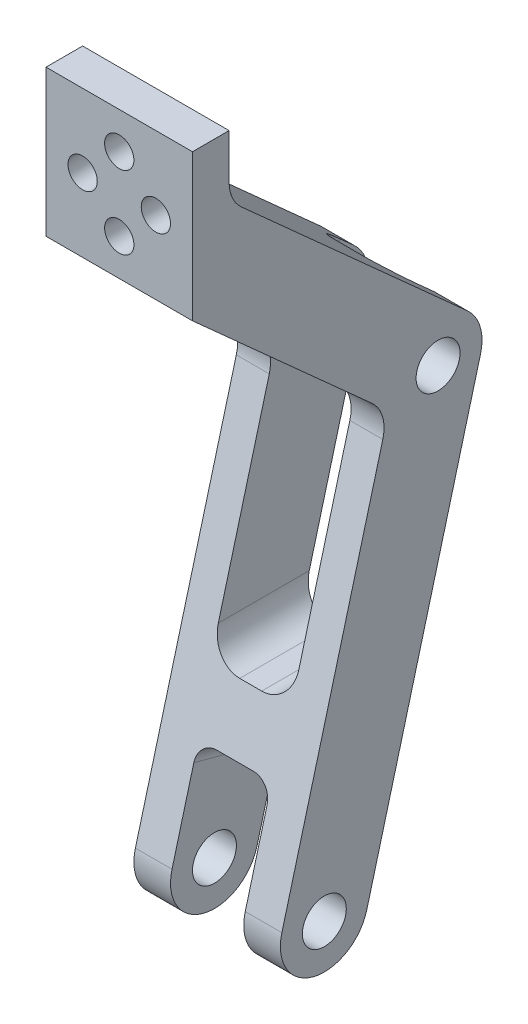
ISO-10303-21;
HEADER;
FILE_DESCRIPTION(('STEP AP214'),'2;1');
FILE_NAME('part.step','',(''),(''),'','','');
FILE_SCHEMA(('AUTOMOTIVE_DESIGN { 1 0 10303 214 1 1 1 1 }'));
ENDSEC;
DATA;
#1=APPLICATION_CONTEXT('core data for automotive mechanical design processes');
#2=APPLICATION_PROTOCOL_DEFINITION('international standard','automotive_design',2000,#1);
#3=PRODUCT_CONTEXT('',#1,'mechanical');
#4=PRODUCT('Part','Part','',(#3));
#5=PRODUCT_RELATED_PRODUCT_CATEGORY('part','',(#4));
#6=PRODUCT_DEFINITION_FORMATION('','',#4);
#7=PRODUCT_DEFINITION_CONTEXT('part definition',#1,'design');
#8=PRODUCT_DEFINITION('design','',#6,#7);
#9=PRODUCT_DEFINITION_SHAPE('','',#8);
#10=(LENGTH_UNIT() NAMED_UNIT(*) SI_UNIT(.MILLI.,.METRE.));
#11=(NAMED_UNIT(*) PLANE_ANGLE_UNIT() SI_UNIT($,.RADIAN.));
#12=(NAMED_UNIT(*) SI_UNIT($,.STERADIAN.) SOLID_ANGLE_UNIT());
#13=UNCERTAINTY_MEASURE_WITH_UNIT(LENGTH_MEASURE(1.E-05),#10,'distance_accuracy_value','');
#14=(GEOMETRIC_REPRESENTATION_CONTEXT(3) GLOBAL_UNCERTAINTY_ASSIGNED_CONTEXT((#13)) GLOBAL_UNIT_ASSIGNED_CONTEXT((#10,
#11,#12)) REPRESENTATION_CONTEXT('',''));
#15=CARTESIAN_POINT('',(0.,0.,0.));
#16=DIRECTION('',(0.,0.,1.));
#17=DIRECTION('',(1.,0.,0.));
#18=AXIS2_PLACEMENT_3D('',#15,#16,#17);
#19=CARTESIAN_POINT('',(10.,57.9555495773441,-15.5291427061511));
#20=DIRECTION('',(-1.,0.,0.));
#21=DIRECTION('',(0.,0.,1.));
#22=AXIS2_PLACEMENT_3D('',#19,#20,#21);
#23=CYLINDRICAL_SURFACE('',#22,6.00000000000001);
#24=CARTESIAN_POINT('',(5.5,57.9555495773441,-15.5291427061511));
#25=DIRECTION('',(1.,0.,0.));
#26=DIRECTION('',(0.,0.,-1.));
#27=AXIS2_PLACEMENT_3D('',#24,#25,#26);
#28=CIRCLE('',#27,6.00000000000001);
#29=CARTESIAN_POINT('',(5.5,56.402635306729,-21.3246976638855));
#30=VERTEX_POINT('',#29);
#31=CARTESIAN_POINT('',(5.5,62.419793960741,-19.5379482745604));
#32=VERTEX_POINT('',#31);
#33=EDGE_CURVE('E422',#30,#32,#28,.T.);
#34=ORIENTED_EDGE('',*,*,#33,.T.);
#35=DIRECTION('',(-1.,0.,0.));
#36=VECTOR('',#35,1.);
#37=CARTESIAN_POINT('',(10.,62.419793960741,-19.5379482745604));
#38=LINE('',#37,#36);
#39=CARTESIAN_POINT('',(10.,62.419793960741,-19.5379482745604));
#40=VERTEX_POINT('',#39);
#41=EDGE_CURVE('E426',#40,#32,#38,.T.);
#42=ORIENTED_EDGE('',*,*,#41,.F.);
#43=CARTESIAN_POINT('',(10.,57.9555495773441,-15.5291427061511));
#44=DIRECTION('',(1.,0.,0.));
#45=DIRECTION('',(0.,0.,-1.));
#46=AXIS2_PLACEMENT_3D('',#43,#44,#45);
#47=CIRCLE('',#46,6.00000000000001);
#48=CARTESIAN_POINT('',(10.,56.402635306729,-21.3246976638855));
#49=VERTEX_POINT('',#48);
#50=EDGE_CURVE('E657',#49,#40,#47,.T.);
#51=ORIENTED_EDGE('',*,*,#50,.F.);
#52=DIRECTION('',(-1.,0.,0.));
#53=VECTOR('',#52,1.);
#54=CARTESIAN_POINT('',(10.,56.402635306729,-21.3246976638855));
#55=LINE('',#54,#53);
#56=EDGE_CURVE('E429',#49,#30,#55,.T.);
#57=ORIENTED_EDGE('',*,*,#56,.T.);
#58=EDGE_LOOP('',(#34,#42,#51,#57));
#59=FACE_BOUND('',#58,.T.);
#60=ADVANCED_FACE('F43',(#59),#23,.T.);
#61=CARTESIAN_POINT('',(10.,57.9555495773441,-15.5291427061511));
#62=DIRECTION('',(-1.,0.,0.));
#63=DIRECTION('',(0.,0.,1.));
#64=AXIS2_PLACEMENT_3D('',#61,#62,#63);
#65=CYLINDRICAL_SURFACE('',#64,3.);
#66=CARTESIAN_POINT('',(-5.5,57.9555495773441,-15.5291427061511));
#67=DIRECTION('',(-1.,0.,0.));
#68=DIRECTION('',(0.,0.,1.));
#69=AXIS2_PLACEMENT_3D('',#66,#67,#68);
#70=CIRCLE('',#69,3.);
#71=CARTESIAN_POINT('',(-5.5,57.9555495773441,-12.5291427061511));
#72=VERTEX_POINT('',#71);
#73=EDGE_CURVE('E696',#72,#72,#70,.T.);
#74=ORIENTED_EDGE('',*,*,#73,.F.);
#75=EDGE_LOOP('',(#74));
#76=FACE_BOUND('',#75,.T.);
#77=CARTESIAN_POINT('',(-10.,57.9555495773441,-15.5291427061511));
#78=DIRECTION('',(1.,0.,0.));
#79=DIRECTION('',(0.,0.,-1.));
#80=AXIS2_PLACEMENT_3D('',#77,#78,#79);
#81=CIRCLE('',#80,3.);
#82=CARTESIAN_POINT('',(-10.,57.9555495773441,-18.5291427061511));
#83=VERTEX_POINT('',#82);
#84=EDGE_CURVE('E643',#83,#83,#81,.T.);
#85=ORIENTED_EDGE('',*,*,#84,.F.);
#86=EDGE_LOOP('',(#85));
#87=FACE_BOUND('',#86,.T.);
#88=ADVANCED_FACE('F357',(#76,#87),#65,.F.);
#89=CARTESIAN_POINT('',(10.,54.2816423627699,-3.15668425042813));
#90=DIRECTION('',(1.,0.,0.));
#91=DIRECTION('',(0.,0.,-1.));
#92=AXIS2_PLACEMENT_3D('',#89,#90,#91);
#93=CYLINDRICAL_SURFACE('',#92,5.);
#94=DIRECTION('',(-1.,0.,0.));
#95=VECTOR('',#94,1.);
#96=CARTESIAN_POINT('',(-9.99999999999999,52.9875471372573,-7.98631338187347));
#97=LINE('',#96,#95);
#98=CARTESIAN_POINT('',(-5.5,52.9875471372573,-7.98631338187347));
#99=VERTEX_POINT('',#98);
#100=CARTESIAN_POINT('',(-10.,52.9875471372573,-7.98631338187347));
#101=VERTEX_POINT('',#100);
#102=EDGE_CURVE('E456',#99,#101,#97,.T.);
#103=ORIENTED_EDGE('',*,*,#102,.F.);
#104=CARTESIAN_POINT('',(-5.5,54.2816423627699,-3.15668425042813));
#105=DIRECTION('',(-1.,0.,0.));
#106=DIRECTION('',(0.,0.,1.));
#107=AXIS2_PLACEMENT_3D('',#104,#105,#106);
#108=CIRCLE('',#107,5.);
#109=CARTESIAN_POINT('',(-5.5,58.0018460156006,-6.49735555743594));
#110=VERTEX_POINT('',#109);
#111=EDGE_CURVE('E542',#99,#110,#108,.F.);
#112=ORIENTED_EDGE('',*,*,#111,.T.);
#113=DIRECTION('',(-1.,0.,0.));
#114=VECTOR('',#113,1.);
#115=CARTESIAN_POINT('',(10.,58.0018460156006,-6.49735555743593));
#116=LINE('',#115,#114);
#117=CARTESIAN_POINT('',(-10.,58.0018460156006,-6.49735555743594));
#118=VERTEX_POINT('',#117);
#119=EDGE_CURVE('E460',#118,#110,#116,.F.);
#120=ORIENTED_EDGE('',*,*,#119,.F.);
#121=CARTESIAN_POINT('',(-10.,54.2816423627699,-3.15668425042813));
#122=DIRECTION('',(1.,0.,0.));
#123=DIRECTION('',(0.,0.,-1.));
#124=AXIS2_PLACEMENT_3D('',#121,#122,#123);
#125=CIRCLE('',#124,5.);
#126=EDGE_CURVE('E278',#101,#118,#125,.T.);
#127=ORIENTED_EDGE('',*,*,#126,.F.);
#128=EDGE_LOOP('',(#103,#112,#120,#127));
#129=FACE_BOUND('',#128,.T.);
#130=ADVANCED_FACE('F406',(#129),#93,.F.);
#131=CARTESIAN_POINT('',(10.,0.,0.));
#132=DIRECTION('',(-1.,0.,0.));
#133=DIRECTION('',(0.,0.,1.));
#134=AXIS2_PLACEMENT_3D('',#131,#132,#133);
#135=CYLINDRICAL_SURFACE('',#134,6.);
#136=CARTESIAN_POINT('',(-5.,0.,0.));
#137=DIRECTION('',(-1.,0.,0.));
#138=DIRECTION('',(0.,-1.,0.));
#139=AXIS2_PLACEMENT_3D('',#136,#137,#138);
#140=CIRCLE('',#139,6.);
#141=CARTESIAN_POINT('',(-5.,-1.55291427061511,-5.79555495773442));
#142=VERTEX_POINT('',#141);
#143=CARTESIAN_POINT('',(-5.,1.55291427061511,5.79555495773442));
#144=VERTEX_POINT('',#143);
#145=EDGE_CURVE('E641',#142,#144,#140,.T.);
#146=ORIENTED_EDGE('',*,*,#145,.T.);
#147=DIRECTION('',(-1.,0.,0.));
#148=VECTOR('',#147,1.);
#149=CARTESIAN_POINT('',(10.,1.55291427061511,5.79555495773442));
#150=LINE('',#149,#148);
#151=CARTESIAN_POINT('',(-10.,1.55291427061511,5.79555495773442));
#152=VERTEX_POINT('',#151);
#153=EDGE_CURVE('E492',#144,#152,#150,.T.);
#154=ORIENTED_EDGE('',*,*,#153,.T.);
#155=CARTESIAN_POINT('',(-10.,0.,0.));
#156=DIRECTION('',(1.,0.,0.));
#157=DIRECTION('',(0.,0.,-1.));
#158=AXIS2_PLACEMENT_3D('',#155,#156,#157);
#159=CIRCLE('',#158,6.);
#160=CARTESIAN_POINT('',(-10.,-1.55291427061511,-5.79555495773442));
#161=VERTEX_POINT('',#160);
#162=EDGE_CURVE('E497',#152,#161,#159,.T.);
#163=ORIENTED_EDGE('',*,*,#162,.T.);
#164=DIRECTION('',(-1.,0.,0.));
#165=VECTOR('',#164,1.);
#166=CARTESIAN_POINT('',(10.,-1.55291427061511,-5.79555495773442));
#167=LINE('',#166,#165);
#168=EDGE_CURVE('E452',#142,#161,#167,.T.);
#169=ORIENTED_EDGE('',*,*,#168,.F.);
#170=EDGE_LOOP('',(#146,#154,#163,#169));
#171=FACE_BOUND('',#170,.T.);
#172=ADVANCED_FACE('F403',(#171),#135,.T.);
#173=CARTESIAN_POINT('',(10.,0.,0.));
#174=DIRECTION('',(-1.,0.,0.));
#175=DIRECTION('',(0.,0.,1.));
#176=AXIS2_PLACEMENT_3D('',#173,#174,#175);
#177=CYLINDRICAL_SURFACE('',#176,3.);
#178=CARTESIAN_POINT('',(-5.,0.,0.));
#179=DIRECTION('',(-1.,0.,0.));
#180=DIRECTION('',(0.,-1.,0.));
#181=AXIS2_PLACEMENT_3D('',#178,#179,#180);
#182=CIRCLE('',#181,3.);
#183=CARTESIAN_POINT('',(-5.,-3.,0.));
#184=VERTEX_POINT('',#183);
#185=EDGE_CURVE('E296',#184,#184,#182,.T.);
#186=ORIENTED_EDGE('',*,*,#185,.F.);
#187=EDGE_LOOP('',(#186));
#188=FACE_BOUND('',#187,.T.);
#189=CARTESIAN_POINT('',(-10.,0.,0.));
#190=DIRECTION('',(1.,0.,0.));
#191=DIRECTION('',(0.,0.,-1.));
#192=AXIS2_PLACEMENT_3D('',#189,#190,#191);
#193=CIRCLE('',#192,3.);
#194=CARTESIAN_POINT('',(-10.,0.,-3.));
#195=VERTEX_POINT('',#194);
#196=EDGE_CURVE('E647',#195,#195,#193,.T.);
#197=ORIENTED_EDGE('',*,*,#196,.F.);
#198=EDGE_LOOP('',(#197));
#199=FACE_BOUND('',#198,.T.);
#200=ADVANCED_FACE('F362',(#188,#199),#177,.F.);
#201=CARTESIAN_POINT('',(10.,0.,0.));
#202=DIRECTION('',(1.,0.,0.));
#203=DIRECTION('',(0.,0.,-1.));
#204=AXIS2_PLACEMENT_3D('',#201,#202,#203);
#205=PLANE('',#204);
#206=CARTESIAN_POINT('',(10.,0.,0.));
#207=DIRECTION('',(1.,0.,0.));
#208=DIRECTION('',(0.,0.,-1.));
#209=AXIS2_PLACEMENT_3D('',#206,#207,#208);
#210=CIRCLE('',#209,3.);
#211=CARTESIAN_POINT('',(10.,0.,-3.));
#212=VERTEX_POINT('',#211);
#213=EDGE_CURVE('E501',#212,#212,#210,.T.);
#214=ORIENTED_EDGE('',*,*,#213,.F.);
#215=EDGE_LOOP('',(#214));
#216=FACE_BOUND('',#215,.T.);
#217=CARTESIAN_POINT('',(10.,0.,0.));
#218=DIRECTION('',(1.,0.,0.));
#219=DIRECTION('',(0.,0.,-1.));
#220=AXIS2_PLACEMENT_3D('',#217,#218,#219);
#221=CIRCLE('',#220,6.);
#222=CARTESIAN_POINT('',(10.,1.55291427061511,5.79555495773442));
#223=VERTEX_POINT('',#222);
#224=CARTESIAN_POINT('',(10.,-1.55291427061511,-5.79555495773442));
#225=VERTEX_POINT('',#224);
#226=EDGE_CURVE('E519',#223,#225,#221,.T.);
#227=ORIENTED_EDGE('',*,*,#226,.T.);
#228=DIRECTION('',(0.,0.965925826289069,-0.258819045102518));
#229=VECTOR('',#228,1.);
#230=CARTESIAN_POINT('',(10.,-1.55291427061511,-5.79555495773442));
#231=LINE('',#230,#229);
#232=EDGE_CURVE('E655',#225,#49,#231,.T.);
#233=ORIENTED_EDGE('',*,*,#232,.T.);
#234=ORIENTED_EDGE('',*,*,#50,.T.);
#235=DIRECTION('',(0.,0.668134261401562,0.744040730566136));
#236=VECTOR('',#235,1.);
#237=CARTESIAN_POINT('',(10.,62.419793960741,-19.5379482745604));
#238=LINE('',#237,#236);
#239=CARTESIAN_POINT('',(10.,90.1482002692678,11.3406713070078));
#240=VERTEX_POINT('',#239);
#241=EDGE_CURVE('E443',#40,#240,#238,.T.);
#242=ORIENTED_EDGE('',*,*,#241,.T.);
#243=CARTESIAN_POINT('',(10.,93.8684039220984,8.));
#244=DIRECTION('',(1.,0.,0.));
#245=DIRECTION('',(0.,0.,-1.));
#246=AXIS2_PLACEMENT_3D('',#243,#244,#245);
#247=CIRCLE('',#246,5.);
#248=CARTESIAN_POINT('',(10.,93.8684039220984,13.));
#249=VERTEX_POINT('',#248);
#250=EDGE_CURVE('E288',#240,#249,#247,.F.);
#251=ORIENTED_EDGE('',*,*,#250,.T.);
#252=DIRECTION('',(0.,1.,0.));
#253=VECTOR('',#252,1.);
#254=CARTESIAN_POINT('',(10.,91.6382455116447,13.));
#255=LINE('',#254,#253);
#256=CARTESIAN_POINT('',(10.,100.,13.));
#257=VERTEX_POINT('',#256);
#258=EDGE_CURVE('E660',#249,#257,#255,.T.);
#259=ORIENTED_EDGE('',*,*,#258,.T.);
#260=DIRECTION('',(0.,0.,1.));
#261=VECTOR('',#260,1.);
#262=CARTESIAN_POINT('',(10.,100.,13.));
#263=LINE('',#262,#261);
#264=CARTESIAN_POINT('',(10.,100.,18.));
#265=VERTEX_POINT('',#264);
#266=EDGE_CURVE('E531',#257,#265,#263,.T.);
#267=ORIENTED_EDGE('',*,*,#266,.T.);
#268=DIRECTION('',(0.,-1.,0.));
#269=VECTOR('',#268,1.);
#270=CARTESIAN_POINT('',(10.,100.,18.));
#271=LINE('',#270,#269);
#272=CARTESIAN_POINT('',(10.,80.,18.));
#273=VERTEX_POINT('',#272);
#274=EDGE_CURVE('E479',#265,#273,#271,.T.);
#275=ORIENTED_EDGE('',*,*,#274,.T.);
#276=DIRECTION('',(0.,-0.668134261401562,-0.744040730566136));
#277=VECTOR('',#276,1.);
#278=CARTESIAN_POINT('',(10.,80.,18.));
#279=LINE('',#278,#277);
#280=CARTESIAN_POINT('',(10.,58.0018460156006,-6.49735555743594));
#281=VERTEX_POINT('',#280);
#282=EDGE_CURVE('E469',#273,#281,#279,.T.);
#283=ORIENTED_EDGE('',*,*,#282,.T.);
#284=CARTESIAN_POINT('',(10.,54.2816423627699,-3.15668425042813));
#285=DIRECTION('',(1.,0.,0.));
#286=DIRECTION('',(0.,0.,-1.));
#287=AXIS2_PLACEMENT_3D('',#284,#285,#286);
#288=CIRCLE('',#287,5.);
#289=CARTESIAN_POINT('',(10.,52.9875471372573,-7.98631338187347));
#290=VERTEX_POINT('',#289);
#291=EDGE_CURVE('E284',#281,#290,#288,.F.);
#292=ORIENTED_EDGE('',*,*,#291,.T.);
#293=DIRECTION('',(0.,-0.965925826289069,0.258819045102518));
#294=VECTOR('',#293,1.);
#295=CARTESIAN_POINT('',(10.,1.55291427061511,5.79555495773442));
#296=LINE('',#295,#294);
#297=EDGE_CURVE('E481',#290,#223,#296,.T.);
#298=ORIENTED_EDGE('',*,*,#297,.T.);
#299=EDGE_LOOP('',(#227,#233,#234,#242,#251,#259,#267,#275,#283,#292,#298));
#300=FACE_BOUND('',#299,.T.);
#301=CARTESIAN_POINT('',(10.,57.9555495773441,-15.5291427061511));
#302=DIRECTION('',(1.,0.,0.));
#303=DIRECTION('',(0.,0.,-1.));
#304=AXIS2_PLACEMENT_3D('',#301,#302,#303);
#305=CIRCLE('',#304,3.);
#306=CARTESIAN_POINT('',(10.,57.9555495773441,-18.5291427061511));
#307=VERTEX_POINT('',#306);
#308=EDGE_CURVE('E644',#307,#307,#305,.T.);
#309=ORIENTED_EDGE('',*,*,#308,.F.);
#310=EDGE_LOOP('',(#309));
#311=FACE_BOUND('',#310,.T.);
#312=ADVANCED_FACE('F363',(#216,#300,#311),#205,.T.);
#313=CARTESIAN_POINT('',(-10.,0.,0.));
#314=DIRECTION('',(1.,0.,0.));
#315=DIRECTION('',(0.,0.,-1.));
#316=AXIS2_PLACEMENT_3D('',#313,#314,#315);
#317=PLANE('',#316);
#318=ORIENTED_EDGE('',*,*,#162,.F.);
#319=DIRECTION('',(0.,-0.965925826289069,0.258819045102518));
#320=VECTOR('',#319,1.);
#321=CARTESIAN_POINT('',(-10.,1.55291427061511,5.79555495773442));
#322=LINE('',#321,#320);
#323=EDGE_CURVE('E517',#101,#152,#322,.T.);
#324=ORIENTED_EDGE('',*,*,#323,.F.);
#325=ORIENTED_EDGE('',*,*,#126,.T.);
#326=DIRECTION('',(0.,-0.668134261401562,-0.744040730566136));
#327=VECTOR('',#326,1.);
#328=CARTESIAN_POINT('',(-10.,80.,18.));
#329=LINE('',#328,#327);
#330=CARTESIAN_POINT('',(-10.,80.,18.));
#331=VERTEX_POINT('',#330);
#332=EDGE_CURVE('E515',#331,#118,#329,.T.);
#333=ORIENTED_EDGE('',*,*,#332,.F.);
#334=DIRECTION('',(0.,-1.,0.));
#335=VECTOR('',#334,1.);
#336=CARTESIAN_POINT('',(-10.,100.,18.));
#337=LINE('',#336,#335);
#338=CARTESIAN_POINT('',(-10.,100.,18.));
#339=VERTEX_POINT('',#338);
#340=EDGE_CURVE('E513',#339,#331,#337,.T.);
#341=ORIENTED_EDGE('',*,*,#340,.F.);
#342=DIRECTION('',(0.,0.,1.));
#343=VECTOR('',#342,1.);
#344=CARTESIAN_POINT('',(-10.,100.,13.));
#345=LINE('',#344,#343);
#346=CARTESIAN_POINT('',(-10.,100.,13.));
#347=VERTEX_POINT('',#346);
#348=EDGE_CURVE('E511',#347,#339,#345,.T.);
#349=ORIENTED_EDGE('',*,*,#348,.F.);
#350=DIRECTION('',(0.,1.,0.));
#351=VECTOR('',#350,1.);
#352=CARTESIAN_POINT('',(-10.,91.6382455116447,13.));
#353=LINE('',#352,#351);
#354=CARTESIAN_POINT('',(-10.,93.8684039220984,13.));
#355=VERTEX_POINT('',#354);
#356=EDGE_CURVE('E509',#355,#347,#353,.T.);
#357=ORIENTED_EDGE('',*,*,#356,.F.);
#358=CARTESIAN_POINT('',(-10.,93.8684039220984,8.));
#359=DIRECTION('',(1.,0.,0.));
#360=DIRECTION('',(0.,0.,-1.));
#361=AXIS2_PLACEMENT_3D('',#358,#359,#360);
#362=CIRCLE('',#361,5.);
#363=CARTESIAN_POINT('',(-10.,90.1482002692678,11.3406713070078));
#364=VERTEX_POINT('',#363);
#365=EDGE_CURVE('E286',#355,#364,#362,.T.);
#366=ORIENTED_EDGE('',*,*,#365,.T.);
#367=DIRECTION('',(0.,0.668134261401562,0.744040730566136));
#368=VECTOR('',#367,1.);
#369=CARTESIAN_POINT('',(-10.,62.419793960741,-19.5379482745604));
#370=LINE('',#369,#368);
#371=CARTESIAN_POINT('',(-10.,62.419793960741,-19.5379482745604));
#372=VERTEX_POINT('',#371);
#373=EDGE_CURVE('E507',#372,#364,#370,.T.);
#374=ORIENTED_EDGE('',*,*,#373,.F.);
#375=CARTESIAN_POINT('',(-10.,57.9555495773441,-15.5291427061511));
#376=DIRECTION('',(1.,0.,0.));
#377=DIRECTION('',(0.,0.,-1.));
#378=AXIS2_PLACEMENT_3D('',#375,#376,#377);
#379=CIRCLE('',#378,6.00000000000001);
#380=CARTESIAN_POINT('',(-10.,56.402635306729,-21.3246976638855));
#381=VERTEX_POINT('',#380);
#382=EDGE_CURVE('E504',#381,#372,#379,.T.);
#383=ORIENTED_EDGE('',*,*,#382,.F.);
#384=DIRECTION('',(0.,0.965925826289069,-0.258819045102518));
#385=VECTOR('',#384,1.);
#386=CARTESIAN_POINT('',(-10.,-1.55291427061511,-5.79555495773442));
#387=LINE('',#386,#385);
#388=EDGE_CURVE('E500',#161,#381,#387,.T.);
#389=ORIENTED_EDGE('',*,*,#388,.F.);
#390=EDGE_LOOP('',(#318,#324,#325,#333,#341,#349,#357,#366,#374,#383,#389));
#391=FACE_BOUND('',#390,.T.);
#392=ORIENTED_EDGE('',*,*,#196,.T.);
#393=EDGE_LOOP('',(#392));
#394=FACE_BOUND('',#393,.T.);
#395=ORIENTED_EDGE('',*,*,#84,.T.);
#396=EDGE_LOOP('',(#395));
#397=FACE_BOUND('',#396,.T.);
#398=ADVANCED_FACE('F366',(#391,#394,#397),#317,.F.);
#399=CARTESIAN_POINT('',(5.,0.,0.));
#400=DIRECTION('',(1.,0.,0.));
#401=DIRECTION('',(0.,1.,0.));
#402=AXIS2_PLACEMENT_3D('',#399,#400,#401);
#403=CIRCLE('',#402,6.);
#404=CARTESIAN_POINT('',(5.,1.55291427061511,5.79555495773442));
#405=VERTEX_POINT('',#404);
#406=CARTESIAN_POINT('',(5.,-1.55291427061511,-5.79555495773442));
#407=VERTEX_POINT('',#406);
#408=EDGE_CURVE('E300',#405,#407,#403,.T.);
#409=ORIENTED_EDGE('',*,*,#408,.T.);
#410=EDGE_CURVE('E453',#225,#407,#167,.T.);
#411=ORIENTED_EDGE('',*,*,#410,.F.);
#412=ORIENTED_EDGE('',*,*,#226,.F.);
#413=EDGE_CURVE('E490',#223,#405,#150,.T.);
#414=ORIENTED_EDGE('',*,*,#413,.T.);
#415=EDGE_LOOP('',(#409,#411,#412,#414));
#416=FACE_BOUND('',#415,.T.);
#417=ADVANCED_FACE('F370',(#416),#135,.T.);
#418=CARTESIAN_POINT('',(10.,-1.55291427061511,-5.79555495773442));
#419=DIRECTION('',(0.,0.258819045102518,0.965925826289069));
#420=DIRECTION('',(0.,-0.965925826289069,0.258819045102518));
#421=AXIS2_PLACEMENT_3D('',#418,#419,#420);
#422=PLANE('',#421);
#423=CARTESIAN_POINT('',(-5.5,56.402635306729,-21.3246976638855));
#424=VERTEX_POINT('',#423);
#425=EDGE_CURVE('E444',#424,#381,#55,.T.);
#426=ORIENTED_EDGE('',*,*,#425,.F.);
#427=DIRECTION('',(0.,-0.965925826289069,0.258819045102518));
#428=VECTOR('',#427,1.);
#429=CARTESIAN_POINT('',(-5.5,-1.55291427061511,-5.79555495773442));
#430=LINE('',#429,#428);
#431=CARTESIAN_POINT('',(-5.5,27.,-13.4462852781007));
#432=VERTEX_POINT('',#431);
#433=EDGE_CURVE('E599',#424,#432,#430,.T.);
#434=ORIENTED_EDGE('',*,*,#433,.T.);
#435=CARTESIAN_POINT('',(-1.5,27.,-13.4462852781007));
#436=DIRECTION('',(0.,0.258819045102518,0.965925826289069));
#437=DIRECTION('',(0.,0.965925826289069,-0.258819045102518));
#438=AXIS2_PLACEMENT_3D('',#435,#436,#437);
#439=ELLIPSE('',#438,4.14110472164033,4.);
#440=CARTESIAN_POINT('',(-1.5,23.,-12.3744885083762));
#441=VERTEX_POINT('',#440);
#442=EDGE_CURVE('E11',#432,#441,#439,.T.);
#443=ORIENTED_EDGE('',*,*,#442,.T.);
#444=DIRECTION('',(1.,0.,0.));
#445=VECTOR('',#444,1.);
#446=CARTESIAN_POINT('',(10.,23.,-12.3744885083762));
#447=LINE('',#446,#445);
#448=CARTESIAN_POINT('',(1.5,23.,-12.3744885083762));
#449=VERTEX_POINT('',#448);
#450=EDGE_CURVE('E597',#441,#449,#447,.T.);
#451=ORIENTED_EDGE('',*,*,#450,.T.);
#452=CARTESIAN_POINT('',(1.5,27.,-13.4462852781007));
#453=DIRECTION('',(0.,0.258819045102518,0.965925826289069));
#454=DIRECTION('',(0.,0.965925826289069,-0.258819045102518));
#455=AXIS2_PLACEMENT_3D('',#452,#453,#454);
#456=ELLIPSE('',#455,4.14110472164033,4.);
#457=CARTESIAN_POINT('',(5.5,27.,-13.4462852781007));
#458=VERTEX_POINT('',#457);
#459=EDGE_CURVE('E587',#449,#458,#456,.T.);
#460=ORIENTED_EDGE('',*,*,#459,.T.);
#461=DIRECTION('',(0.,0.965925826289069,-0.258819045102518));
#462=VECTOR('',#461,1.);
#463=CARTESIAN_POINT('',(5.5,-1.55291427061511,-5.79555495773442));
#464=LINE('',#463,#462);
#465=EDGE_CURVE('E432',#458,#30,#464,.T.);
#466=ORIENTED_EDGE('',*,*,#465,.T.);
#467=ORIENTED_EDGE('',*,*,#56,.F.);
#468=ORIENTED_EDGE('',*,*,#232,.F.);
#469=ORIENTED_EDGE('',*,*,#410,.T.);
#470=DIRECTION('',(0.,-0.965925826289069,0.258819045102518));
#471=VECTOR('',#470,1.);
#472=CARTESIAN_POINT('',(5.,-7.34846922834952,-4.24264068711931));
#473=LINE('',#472,#471);
#474=CARTESIAN_POINT('',(5.,9.55523273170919,-8.77197397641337));
#475=VERTEX_POINT('',#474);
#476=EDGE_CURVE('E627',#475,#407,#473,.T.);
#477=ORIENTED_EDGE('',*,*,#476,.F.);
#478=CARTESIAN_POINT('',(2.50000000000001,9.55523273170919,-8.77197397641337));
#479=DIRECTION('',(0.,-0.258819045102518,-0.965925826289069));
#480=DIRECTION('',(0.,0.965925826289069,-0.258819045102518));
#481=AXIS2_PLACEMENT_3D('',#478,#479,#480);
#482=CIRCLE('',#481,2.49999999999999);
#483=CARTESIAN_POINT('',(2.50000000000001,11.9700472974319,-9.41902158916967));
#484=VERTEX_POINT('',#483);
#485=EDGE_CURVE('E624',#484,#475,#482,.T.);
#486=ORIENTED_EDGE('',*,*,#485,.F.);
#487=DIRECTION('',(1.,0.,0.));
#488=VECTOR('',#487,1.);
#489=CARTESIAN_POINT('',(-2.5,11.9700472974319,-9.41902158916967));
#490=LINE('',#489,#488);
#491=CARTESIAN_POINT('',(-2.5,11.9700472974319,-9.41902158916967));
#492=VERTEX_POINT('',#491);
#493=EDGE_CURVE('E621',#492,#484,#490,.T.);
#494=ORIENTED_EDGE('',*,*,#493,.F.);
#495=CARTESIAN_POINT('',(-2.5,9.55523273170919,-8.77197397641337));
#496=DIRECTION('',(0.,-0.258819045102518,-0.965925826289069));
#497=DIRECTION('',(0.,0.965925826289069,-0.258819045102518));
#498=AXIS2_PLACEMENT_3D('',#495,#496,#497);
#499=CIRCLE('',#498,2.49999999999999);
#500=CARTESIAN_POINT('',(-5.,9.55523273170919,-8.77197397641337));
#501=VERTEX_POINT('',#500);
#502=EDGE_CURVE('E618',#501,#492,#499,.T.);
#503=ORIENTED_EDGE('',*,*,#502,.F.);
#504=DIRECTION('',(0.,0.965925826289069,-0.258819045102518));
#505=VECTOR('',#504,1.);
#506=CARTESIAN_POINT('',(-5.,-7.34846922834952,-4.24264068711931));
#507=LINE('',#506,#505);
#508=EDGE_CURVE('E615',#142,#501,#507,.T.);
#509=ORIENTED_EDGE('',*,*,#508,.F.);
#510=ORIENTED_EDGE('',*,*,#168,.T.);
#511=ORIENTED_EDGE('',*,*,#388,.T.);
#512=EDGE_LOOP('',(#426,#434,#443,#451,#460,#466,#467,#468,#469,#477,#486,#494,#503,#509,#510,#511));
#513=FACE_BOUND('',#512,.T.);
#514=ADVANCED_FACE('F397',(#513),#422,.F.);
#515=CARTESIAN_POINT('',(-5.5,62.419793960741,-19.5379482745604));
#516=VERTEX_POINT('',#515);
#517=EDGE_CURVE('E445',#516,#372,#38,.T.);
#518=ORIENTED_EDGE('',*,*,#517,.F.);
#519=CARTESIAN_POINT('',(-5.5,57.9555495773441,-15.5291427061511));
#520=DIRECTION('',(-1.,0.,0.));
#521=DIRECTION('',(0.,0.,1.));
#522=AXIS2_PLACEMENT_3D('',#519,#520,#521);
#523=CIRCLE('',#522,6.00000000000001);
#524=EDGE_CURVE('E603',#516,#424,#523,.T.);
#525=ORIENTED_EDGE('',*,*,#524,.T.);
#526=ORIENTED_EDGE('',*,*,#425,.T.);
#527=ORIENTED_EDGE('',*,*,#382,.T.);
#528=EDGE_LOOP('',(#518,#525,#526,#527));
#529=FACE_BOUND('',#528,.T.);
#530=ADVANCED_FACE('F393',(#529),#23,.T.);
#531=CARTESIAN_POINT('',(10.,62.419793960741,-19.5379482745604));
#532=DIRECTION('',(0.,-0.744040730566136,0.668134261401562));
#533=DIRECTION('',(0.,-0.668134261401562,-0.744040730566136));
#534=AXIS2_PLACEMENT_3D('',#531,#532,#533);
#535=PLANE('',#534);
#536=CARTESIAN_POINT('',(0.,85.,5.60758604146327));
#537=DIRECTION('',(0.,-0.744040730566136,0.668134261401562));
#538=DIRECTION('',(0.,0.668134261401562,0.744040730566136));
#539=AXIS2_PLACEMENT_3D('',#536,#537,#538);
#540=ELLIPSE('',#539,2.99341033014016,2.);
#541=CARTESIAN_POINT('',(0.,87.,7.83480525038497));
#542=VERTEX_POINT('',#541);
#543=EDGE_CURVE('E558',#542,#542,#540,.T.);
#544=ORIENTED_EDGE('',*,*,#543,.T.);
#545=EDGE_LOOP('',(#544));
#546=FACE_BOUND('',#545,.T.);
#547=DIRECTION('',(0.,0.668134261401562,0.744040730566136));
#548=VECTOR('',#547,1.);
#549=CARTESIAN_POINT('',(5.5,62.419793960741,-19.5379482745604));
#550=LINE('',#549,#548);
#551=CARTESIAN_POINT('',(5.5,64.,-17.7782156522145));
#552=VERTEX_POINT('',#551);
#553=EDGE_CURVE('E433',#32,#552,#550,.T.);
#554=ORIENTED_EDGE('',*,*,#553,.T.);
#555=CARTESIAN_POINT('',(1.5,64.,-17.7782156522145));
#556=DIRECTION('',(0.,-0.744040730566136,0.668134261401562));
#557=DIRECTION('',(0.,-0.668134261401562,-0.744040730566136));
#558=AXIS2_PLACEMENT_3D('',#555,#556,#557);
#559=ELLIPSE('',#558,5.98682066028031,4.);
#560=CARTESIAN_POINT('',(1.5,68.,-13.3237772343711));
#561=VERTEX_POINT('',#560);
#562=EDGE_CURVE('E579',#552,#561,#559,.T.);
#563=ORIENTED_EDGE('',*,*,#562,.T.);
#564=DIRECTION('',(-1.,0.,0.));
#565=VECTOR('',#564,1.);
#566=CARTESIAN_POINT('',(10.,68.,-13.3237772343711));
#567=LINE('',#566,#565);
#568=CARTESIAN_POINT('',(-1.5,68.,-13.3237772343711));
#569=VERTEX_POINT('',#568);
#570=EDGE_CURVE('E559',#561,#569,#567,.T.);
#571=ORIENTED_EDGE('',*,*,#570,.T.);
#572=CARTESIAN_POINT('',(-1.5,64.,-17.7782156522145));
#573=DIRECTION('',(0.,-0.744040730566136,0.668134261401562));
#574=DIRECTION('',(0.,-0.668134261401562,-0.744040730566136));
#575=AXIS2_PLACEMENT_3D('',#572,#573,#574);
#576=ELLIPSE('',#575,5.98682066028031,4.);
#577=CARTESIAN_POINT('',(-5.5,64.,-17.7782156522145));
#578=VERTEX_POINT('',#577);
#579=EDGE_CURVE('E583',#569,#578,#576,.T.);
#580=ORIENTED_EDGE('',*,*,#579,.T.);
#581=DIRECTION('',(0.,-0.668134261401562,-0.744040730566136));
#582=VECTOR('',#581,1.);
#583=CARTESIAN_POINT('',(-5.5,62.419793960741,-19.5379482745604));
#584=LINE('',#583,#582);
#585=EDGE_CURVE('E671',#578,#516,#584,.T.);
#586=ORIENTED_EDGE('',*,*,#585,.T.);
#587=ORIENTED_EDGE('',*,*,#517,.T.);
#588=ORIENTED_EDGE('',*,*,#373,.T.);
#589=DIRECTION('',(-1.,0.,0.));
#590=VECTOR('',#589,1.);
#591=CARTESIAN_POINT('',(10.,90.1482002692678,11.3406713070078));
#592=LINE('',#591,#590);
#593=CARTESIAN_POINT('',(-6.99450161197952,90.1482002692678,11.3406713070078));
#594=VERTEX_POINT('',#593);
#595=EDGE_CURVE('E270',#364,#594,#592,.F.);
#596=ORIENTED_EDGE('',*,*,#595,.T.);
#597=CARTESIAN_POINT('',(-5.,89.9999999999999,11.1756340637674));
#598=DIRECTION('',(0.,-0.744040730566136,0.668134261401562));
#599=DIRECTION('',(0.,0.668134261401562,0.744040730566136));
#600=AXIS2_PLACEMENT_3D('',#597,#598,#599);
#601=ELLIPSE('',#600,2.99341033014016,2.);
#602=CARTESIAN_POINT('',(-3.00549838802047,90.1482002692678,11.3406713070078));
#603=VERTEX_POINT('',#602);
#604=EDGE_CURVE('E255',#594,#603,#601,.T.);
#605=ORIENTED_EDGE('',*,*,#604,.T.);
#606=CARTESIAN_POINT('',(3.00549838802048,90.1482002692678,11.3406713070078));
#607=VERTEX_POINT('',#606);
#608=EDGE_CURVE('E268',#603,#607,#592,.F.);
#609=ORIENTED_EDGE('',*,*,#608,.T.);
#610=CARTESIAN_POINT('',(5.,89.9999999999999,11.1756340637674));
#611=DIRECTION('',(0.,-0.744040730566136,0.668134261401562));
#612=DIRECTION('',(0.,0.668134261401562,0.744040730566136));
#613=AXIS2_PLACEMENT_3D('',#610,#611,#612);
#614=ELLIPSE('',#613,2.99341033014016,2.);
#615=CARTESIAN_POINT('',(6.99450161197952,90.1482002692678,11.3406713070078));
#616=VERTEX_POINT('',#615);
#617=EDGE_CURVE('E719',#607,#616,#614,.T.);
#618=ORIENTED_EDGE('',*,*,#617,.T.);
#619=EDGE_CURVE('E276',#616,#240,#592,.F.);
#620=ORIENTED_EDGE('',*,*,#619,.T.);
#621=ORIENTED_EDGE('',*,*,#241,.F.);
#622=ORIENTED_EDGE('',*,*,#41,.T.);
#623=EDGE_LOOP('',(#554,#563,#571,#580,#586,#587,#588,#596,#605,#609,#618,#620,#621,#622));
#624=FACE_BOUND('',#623,.T.);
#625=ADVANCED_FACE('F266',(#546,#624),#535,.F.);
#626=CARTESIAN_POINT('',(10.,91.6382455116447,13.));
#627=DIRECTION('',(0.,0.,1.));
#628=DIRECTION('',(0.,-1.,0.));
#629=AXIS2_PLACEMENT_3D('',#626,#627,#628);
#630=PLANE('',#629);
#631=DIRECTION('',(-1.,0.,0.));
#632=VECTOR('',#631,1.);
#633=CARTESIAN_POINT('',(-10.,93.8684039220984,13.));
#634=LINE('',#633,#632);
#635=CARTESIAN_POINT('',(1.64908772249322,93.8684039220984,13.));
#636=VERTEX_POINT('',#635);
#637=EDGE_CURVE('E279',#249,#636,#634,.T.);
#638=ORIENTED_EDGE('',*,*,#637,.T.);
#639=CARTESIAN_POINT('',(0.,95.,13.));
#640=DIRECTION('',(0.,0.,1.));
#641=DIRECTION('',(0.,-1.,0.));
#642=AXIS2_PLACEMENT_3D('',#639,#640,#641);
#643=CIRCLE('',#642,2.);
#644=CARTESIAN_POINT('',(-1.64908772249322,93.8684039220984,13.));
#645=VERTEX_POINT('',#644);
#646=EDGE_CURVE('E609',#636,#645,#643,.T.);
#647=ORIENTED_EDGE('',*,*,#646,.T.);
#648=EDGE_CURVE('E462',#645,#355,#634,.T.);
#649=ORIENTED_EDGE('',*,*,#648,.T.);
#650=ORIENTED_EDGE('',*,*,#356,.T.);
#651=DIRECTION('',(-1.,0.,0.));
#652=VECTOR('',#651,1.);
#653=CARTESIAN_POINT('',(10.,100.,13.));
#654=LINE('',#653,#652);
#655=EDGE_CURVE('E448',#257,#347,#654,.T.);
#656=ORIENTED_EDGE('',*,*,#655,.F.);
#657=ORIENTED_EDGE('',*,*,#258,.F.);
#658=EDGE_LOOP('',(#638,#647,#649,#650,#656,#657));
#659=FACE_BOUND('',#658,.T.);
#660=ADVANCED_FACE('F386',(#659),#630,.F.);
#661=CARTESIAN_POINT('',(10.,100.,13.));
#662=DIRECTION('',(0.,-1.,0.));
#663=DIRECTION('',(0.,0.,-1.));
#664=AXIS2_PLACEMENT_3D('',#661,#662,#663);
#665=PLANE('',#664);
#666=ORIENTED_EDGE('',*,*,#348,.T.);
#667=DIRECTION('',(-1.,0.,0.));
#668=VECTOR('',#667,1.);
#669=CARTESIAN_POINT('',(10.,100.,18.));
#670=LINE('',#669,#668);
#671=EDGE_CURVE('E522',#265,#339,#670,.T.);
#672=ORIENTED_EDGE('',*,*,#671,.F.);
#673=ORIENTED_EDGE('',*,*,#266,.F.);
#674=ORIENTED_EDGE('',*,*,#655,.T.);
#675=EDGE_LOOP('',(#666,#672,#673,#674));
#676=FACE_BOUND('',#675,.T.);
#677=ADVANCED_FACE('F382',(#676),#665,.F.);
#678=CARTESIAN_POINT('',(10.,100.,18.));
#679=DIRECTION('',(0.,0.,-1.));
#680=DIRECTION('',(0.,1.,0.));
#681=AXIS2_PLACEMENT_3D('',#678,#679,#680);
#682=PLANE('',#681);
#683=CARTESIAN_POINT('',(5.,89.9999999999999,18.));
#684=DIRECTION('',(0.,0.,-1.));
#685=DIRECTION('',(0.,1.,0.));
#686=AXIS2_PLACEMENT_3D('',#683,#684,#685);
#687=CIRCLE('',#686,2.);
#688=CARTESIAN_POINT('',(5.,91.9999999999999,18.));
#689=VERTEX_POINT('',#688);
#690=EDGE_CURVE('E714',#689,#689,#687,.T.);
#691=ORIENTED_EDGE('',*,*,#690,.T.);
#692=EDGE_LOOP('',(#691));
#693=FACE_BOUND('',#692,.T.);
#694=CARTESIAN_POINT('',(0.,85.,18.));
#695=DIRECTION('',(0.,0.,-1.));
#696=DIRECTION('',(0.,1.,0.));
#697=AXIS2_PLACEMENT_3D('',#694,#695,#696);
#698=CIRCLE('',#697,2.);
#699=CARTESIAN_POINT('',(0.,87.,18.));
#700=VERTEX_POINT('',#699);
#701=EDGE_CURVE('E555',#700,#700,#698,.T.);
#702=ORIENTED_EDGE('',*,*,#701,.T.);
#703=EDGE_LOOP('',(#702));
#704=FACE_BOUND('',#703,.T.);
#705=CARTESIAN_POINT('',(-5.,89.9999999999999,18.));
#706=DIRECTION('',(0.,0.,-1.));
#707=DIRECTION('',(0.,1.,0.));
#708=AXIS2_PLACEMENT_3D('',#705,#706,#707);
#709=CIRCLE('',#708,2.);
#710=CARTESIAN_POINT('',(-5.,91.9999999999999,18.));
#711=VERTEX_POINT('',#710);
#712=EDGE_CURVE('E271',#711,#711,#709,.T.);
#713=ORIENTED_EDGE('',*,*,#712,.T.);
#714=EDGE_LOOP('',(#713));
#715=FACE_BOUND('',#714,.T.);
#716=CARTESIAN_POINT('',(0.,95.,18.));
#717=DIRECTION('',(0.,0.,-1.));
#718=DIRECTION('',(0.,1.,0.));
#719=AXIS2_PLACEMENT_3D('',#716,#717,#718);
#720=CIRCLE('',#719,2.);
#721=CARTESIAN_POINT('',(0.,97.,18.));
#722=VERTEX_POINT('',#721);
#723=EDGE_CURVE('E612',#722,#722,#720,.T.);
#724=ORIENTED_EDGE('',*,*,#723,.T.);
#725=EDGE_LOOP('',(#724));
#726=FACE_BOUND('',#725,.T.);
#727=ORIENTED_EDGE('',*,*,#340,.T.);
#728=DIRECTION('',(-1.,0.,0.));
#729=VECTOR('',#728,1.);
#730=CARTESIAN_POINT('',(10.,80.,18.));
#731=LINE('',#730,#729);
#732=EDGE_CURVE('E521',#273,#331,#731,.T.);
#733=ORIENTED_EDGE('',*,*,#732,.F.);
#734=ORIENTED_EDGE('',*,*,#274,.F.);
#735=ORIENTED_EDGE('',*,*,#671,.T.);
#736=EDGE_LOOP('',(#727,#733,#734,#735));
#737=FACE_BOUND('',#736,.T.);
#738=ADVANCED_FACE('F378',(#693,#704,#715,#726,#737),#682,.F.);
#739=CARTESIAN_POINT('',(10.,80.,18.));
#740=DIRECTION('',(0.,0.744040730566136,-0.668134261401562));
#741=DIRECTION('',(0.,0.668134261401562,0.744040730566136));
#742=AXIS2_PLACEMENT_3D('',#739,#740,#741);
#743=PLANE('',#742);
#744=ORIENTED_EDGE('',*,*,#119,.T.);
#745=DIRECTION('',(0.,0.668134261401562,0.744040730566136));
#746=VECTOR('',#745,1.);
#747=CARTESIAN_POINT('',(-5.5,80.,18.));
#748=LINE('',#747,#746);
#749=CARTESIAN_POINT('',(-5.5,64.,0.18224632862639));
#750=VERTEX_POINT('',#749);
#751=EDGE_CURVE('E594',#110,#750,#748,.T.);
#752=ORIENTED_EDGE('',*,*,#751,.T.);
#753=CARTESIAN_POINT('',(-1.5,64.,0.18224632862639));
#754=DIRECTION('',(0.,0.744040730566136,-0.668134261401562));
#755=DIRECTION('',(0.,-0.668134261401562,-0.744040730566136));
#756=AXIS2_PLACEMENT_3D('',#753,#754,#755);
#757=ELLIPSE('',#756,5.98682066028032,4.);
#758=CARTESIAN_POINT('',(-1.5,68.,4.6366847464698));
#759=VERTEX_POINT('',#758);
#760=EDGE_CURVE('E581',#750,#759,#757,.T.);
#761=ORIENTED_EDGE('',*,*,#760,.T.);
#762=DIRECTION('',(1.,0.,0.));
#763=VECTOR('',#762,1.);
#764=CARTESIAN_POINT('',(10.,68.,4.6366847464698));
#765=LINE('',#764,#763);
#766=CARTESIAN_POINT('',(1.5,68.,4.6366847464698));
#767=VERTEX_POINT('',#766);
#768=EDGE_CURVE('E548',#759,#767,#765,.T.);
#769=ORIENTED_EDGE('',*,*,#768,.T.);
#770=CARTESIAN_POINT('',(1.5,64.,0.18224632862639));
#771=DIRECTION('',(0.,0.744040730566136,-0.668134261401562));
#772=DIRECTION('',(0.,-0.668134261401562,-0.744040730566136));
#773=AXIS2_PLACEMENT_3D('',#770,#771,#772);
#774=ELLIPSE('',#773,5.98682066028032,4.);
#775=CARTESIAN_POINT('',(5.5,64.,0.18224632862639));
#776=VERTEX_POINT('',#775);
#777=EDGE_CURVE('E577',#767,#776,#774,.T.);
#778=ORIENTED_EDGE('',*,*,#777,.T.);
#779=DIRECTION('',(0.,-0.668134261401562,-0.744040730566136));
#780=VECTOR('',#779,1.);
#781=CARTESIAN_POINT('',(5.5,80.,18.));
#782=LINE('',#781,#780);
#783=CARTESIAN_POINT('',(5.5,58.0018460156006,-6.49735555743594));
#784=VERTEX_POINT('',#783);
#785=EDGE_CURVE('E470',#776,#784,#782,.T.);
#786=ORIENTED_EDGE('',*,*,#785,.T.);
#787=EDGE_CURVE('E459',#784,#281,#116,.F.);
#788=ORIENTED_EDGE('',*,*,#787,.T.);
#789=ORIENTED_EDGE('',*,*,#282,.F.);
#790=ORIENTED_EDGE('',*,*,#732,.T.);
#791=ORIENTED_EDGE('',*,*,#332,.T.);
#792=EDGE_LOOP('',(#744,#752,#761,#769,#778,#786,#788,#789,#790,#791));
#793=FACE_BOUND('',#792,.T.);
#794=ADVANCED_FACE('F374',(#793),#743,.F.);
#795=CARTESIAN_POINT('',(10.,1.55291427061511,5.79555495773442));
#796=DIRECTION('',(0.,-0.258819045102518,-0.965925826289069));
#797=DIRECTION('',(0.,0.965925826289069,-0.258819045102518));
#798=AXIS2_PLACEMENT_3D('',#795,#796,#797);
#799=PLANE('',#798);
#800=DIRECTION('',(0.,-0.965925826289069,0.258819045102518));
#801=VECTOR('',#800,1.);
#802=CARTESIAN_POINT('',(5.5,1.55291427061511,5.79555495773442));
#803=LINE('',#802,#801);
#804=CARTESIAN_POINT('',(5.5,52.9875471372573,-7.98631338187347));
#805=VERTEX_POINT('',#804);
#806=CARTESIAN_POINT('',(5.5,27.,-1.02297111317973));
#807=VERTEX_POINT('',#806);
#808=EDGE_CURVE('E486',#805,#807,#803,.T.);
#809=ORIENTED_EDGE('',*,*,#808,.T.);
#810=CARTESIAN_POINT('',(1.5,27.,-1.02297111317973));
#811=DIRECTION('',(0.,-0.258819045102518,-0.965925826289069));
#812=DIRECTION('',(0.,0.965925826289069,-0.258819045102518));
#813=AXIS2_PLACEMENT_3D('',#810,#811,#812);
#814=ELLIPSE('',#813,4.14110472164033,4.);
#815=CARTESIAN_POINT('',(1.5,23.,0.0488256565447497));
#816=VERTEX_POINT('',#815);
#817=EDGE_CURVE('E585',#807,#816,#814,.T.);
#818=ORIENTED_EDGE('',*,*,#817,.T.);
#819=DIRECTION('',(-1.,0.,0.));
#820=VECTOR('',#819,1.);
#821=CARTESIAN_POINT('',(10.,23.,0.0488256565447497));
#822=LINE('',#821,#820);
#823=CARTESIAN_POINT('',(-1.5,23.,0.0488256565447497));
#824=VERTEX_POINT('',#823);
#825=EDGE_CURVE('E545',#816,#824,#822,.T.);
#826=ORIENTED_EDGE('',*,*,#825,.T.);
#827=CARTESIAN_POINT('',(-1.5,27.,-1.02297111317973));
#828=DIRECTION('',(0.,-0.258819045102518,-0.965925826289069));
#829=DIRECTION('',(0.,0.965925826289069,-0.258819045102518));
#830=AXIS2_PLACEMENT_3D('',#827,#828,#829);
#831=ELLIPSE('',#830,4.14110472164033,4.);
#832=CARTESIAN_POINT('',(-5.5,27.,-1.02297111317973));
#833=VERTEX_POINT('',#832);
#834=EDGE_CURVE('E51',#824,#833,#831,.T.);
#835=ORIENTED_EDGE('',*,*,#834,.T.);
#836=DIRECTION('',(0.,0.965925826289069,-0.258819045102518));
#837=VECTOR('',#836,1.);
#838=CARTESIAN_POINT('',(-5.5,1.55291427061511,5.79555495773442));
#839=LINE('',#838,#837);
#840=EDGE_CURVE('E588',#833,#99,#839,.T.);
#841=ORIENTED_EDGE('',*,*,#840,.T.);
#842=ORIENTED_EDGE('',*,*,#102,.T.);
#843=ORIENTED_EDGE('',*,*,#323,.T.);
#844=ORIENTED_EDGE('',*,*,#153,.F.);
#845=DIRECTION('',(0.,0.965925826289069,-0.258819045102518));
#846=VECTOR('',#845,1.);
#847=CARTESIAN_POINT('',(-5.,1.55291427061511,5.79555495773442));
#848=LINE('',#847,#846);
#849=CARTESIAN_POINT('',(-5.,12.6610612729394,2.81913593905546));
#850=VERTEX_POINT('',#849);
#851=EDGE_CURVE('E299',#144,#850,#848,.T.);
#852=ORIENTED_EDGE('',*,*,#851,.T.);
#853=CARTESIAN_POINT('',(-2.5,12.6610612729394,2.81913593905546));
#854=DIRECTION('',(0.,-0.258819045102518,-0.965925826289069));
#855=DIRECTION('',(0.,0.965925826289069,-0.258819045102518));
#856=AXIS2_PLACEMENT_3D('',#853,#854,#855);
#857=CIRCLE('',#856,2.49999999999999);
#858=CARTESIAN_POINT('',(-2.5,15.0758758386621,2.17208832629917));
#859=VERTEX_POINT('',#858);
#860=EDGE_CURVE('E290',#850,#859,#857,.T.);
#861=ORIENTED_EDGE('',*,*,#860,.T.);
#862=DIRECTION('',(1.,0.,0.));
#863=VECTOR('',#862,1.);
#864=CARTESIAN_POINT('',(10.,15.0758758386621,2.17208832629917));
#865=LINE('',#864,#863);
#866=CARTESIAN_POINT('',(2.50000000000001,15.0758758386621,2.17208832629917));
#867=VERTEX_POINT('',#866);
#868=EDGE_CURVE('E303',#859,#867,#865,.T.);
#869=ORIENTED_EDGE('',*,*,#868,.T.);
#870=CARTESIAN_POINT('',(2.50000000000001,12.6610612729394,2.81913593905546));
#871=DIRECTION('',(0.,-0.258819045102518,-0.965925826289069));
#872=DIRECTION('',(0.,0.965925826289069,-0.258819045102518));
#873=AXIS2_PLACEMENT_3D('',#870,#871,#872);
#874=CIRCLE('',#873,2.49999999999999);
#875=CARTESIAN_POINT('',(5.,12.6610612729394,2.81913593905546));
#876=VERTEX_POINT('',#875);
#877=EDGE_CURVE('E306',#867,#876,#874,.T.);
#878=ORIENTED_EDGE('',*,*,#877,.T.);
#879=DIRECTION('',(0.,-0.965925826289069,0.258819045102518));
#880=VECTOR('',#879,1.);
#881=CARTESIAN_POINT('',(5.,1.55291427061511,5.79555495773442));
#882=LINE('',#881,#880);
#883=EDGE_CURVE('E294',#876,#405,#882,.T.);
#884=ORIENTED_EDGE('',*,*,#883,.T.);
#885=ORIENTED_EDGE('',*,*,#413,.F.);
#886=ORIENTED_EDGE('',*,*,#297,.F.);
#887=EDGE_CURVE('E457',#290,#805,#97,.T.);
#888=ORIENTED_EDGE('',*,*,#887,.T.);
#889=EDGE_LOOP('',(#809,#818,#826,#835,#841,#842,#843,#844,#852,#861,#869,#878,#884,#885,#886,#888));
#890=FACE_BOUND('',#889,.T.);
#891=ADVANCED_FACE('F360',(#890),#799,.F.);
#892=CARTESIAN_POINT('',(5.,0.,0.));
#893=DIRECTION('',(1.,0.,0.));
#894=DIRECTION('',(0.,1.,0.));
#895=AXIS2_PLACEMENT_3D('',#892,#893,#894);
#896=CIRCLE('',#895,3.);
#897=CARTESIAN_POINT('',(5.,3.,0.));
#898=VERTEX_POINT('',#897);
#899=EDGE_CURVE('E291',#898,#898,#896,.T.);
#900=ORIENTED_EDGE('',*,*,#899,.F.);
#901=EDGE_LOOP('',(#900));
#902=FACE_BOUND('',#901,.T.);
#903=ORIENTED_EDGE('',*,*,#213,.T.);
#904=EDGE_LOOP('',(#903));
#905=FACE_BOUND('',#904,.T.);
#906=ADVANCED_FACE('F355',(#902,#905),#177,.F.);
#907=CARTESIAN_POINT('',(5.5,57.9555495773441,-15.5291427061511));
#908=DIRECTION('',(1.,0.,0.));
#909=DIRECTION('',(0.,0.,-1.));
#910=AXIS2_PLACEMENT_3D('',#907,#908,#909);
#911=CIRCLE('',#910,3.);
#912=CARTESIAN_POINT('',(5.5,57.9555495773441,-18.5291427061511));
#913=VERTEX_POINT('',#912);
#914=EDGE_CURVE('E440',#913,#913,#911,.T.);
#915=ORIENTED_EDGE('',*,*,#914,.F.);
#916=EDGE_LOOP('',(#915));
#917=FACE_BOUND('',#916,.T.);
#918=ORIENTED_EDGE('',*,*,#308,.T.);
#919=EDGE_LOOP('',(#918));
#920=FACE_BOUND('',#919,.T.);
#921=ADVANCED_FACE('F351',(#917,#920),#65,.F.);
#922=ORIENTED_EDGE('',*,*,#787,.F.);
#923=CARTESIAN_POINT('',(5.5,54.2816423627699,-3.15668425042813));
#924=DIRECTION('',(1.,0.,0.));
#925=DIRECTION('',(0.,0.,-1.));
#926=AXIS2_PLACEMENT_3D('',#923,#924,#925);
#927=CIRCLE('',#926,5.);
#928=EDGE_CURVE('E484',#784,#805,#927,.F.);
#929=ORIENTED_EDGE('',*,*,#928,.T.);
#930=ORIENTED_EDGE('',*,*,#887,.F.);
#931=ORIENTED_EDGE('',*,*,#291,.F.);
#932=EDGE_LOOP('',(#922,#929,#930,#931));
#933=FACE_BOUND('',#932,.T.);
#934=ADVANCED_FACE('F354',(#933),#93,.F.);
#935=CARTESIAN_POINT('',(10.,93.8684039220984,8.));
#936=DIRECTION('',(1.,0.,0.));
#937=DIRECTION('',(0.,0.,-1.));
#938=AXIS2_PLACEMENT_3D('',#935,#936,#937);
#939=CYLINDRICAL_SURFACE('',#938,5.);
#940=ORIENTED_EDGE('',*,*,#619,.F.);
#941=CARTESIAN_POINT('',(7.,89.9999999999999,4.83212198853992));
#942=CARTESIAN_POINT('',(7.00000046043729,89.9258423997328,4.92267854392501));
#943=CARTESIAN_POINT('',(6.9958828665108,89.8548793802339,5.01583436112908));
#944=CARTESIAN_POINT('',(6.98144596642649,89.7198496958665,5.20658221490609));
#945=CARTESIAN_POINT('',(6.97112213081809,89.6557881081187,5.30417744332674));
#946=CARTESIAN_POINT('',(6.9335669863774,89.4739928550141,5.6034000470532));
#947=CARTESIAN_POINT('',(6.89977455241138,89.3670918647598,5.81092105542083));
#948=CARTESIAN_POINT('',(6.8453659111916,89.2271585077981,6.13620722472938));
#949=CARTESIAN_POINT('',(6.8261250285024,89.1831721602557,6.24972993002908));
#950=CARTESIAN_POINT('',(6.78838133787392,89.1035433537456,6.47983356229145));
#951=CARTESIAN_POINT('',(6.76987853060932,89.0679009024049,6.59641449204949));
#952=CARTESIAN_POINT('',(6.73543157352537,89.0052360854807,6.83191957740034));
#953=CARTESIAN_POINT('',(6.7194810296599,88.9781920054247,6.95083701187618));
#954=CARTESIAN_POINT('',(6.69169358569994,88.932815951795,7.19076136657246));
#955=CARTESIAN_POINT('',(6.67985499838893,88.9144804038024,7.31176740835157));
#956=CARTESIAN_POINT('',(6.66046556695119,88.8850048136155,7.57026777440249));
#957=CARTESIAN_POINT('',(6.6536246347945,88.8750327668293,7.70795313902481));
#958=CARTESIAN_POINT('',(6.64780551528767,88.8665255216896,7.98384835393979));
#959=CARTESIAN_POINT('',(6.64882745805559,88.8679905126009,8.12205821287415));
#960=CARTESIAN_POINT('',(6.6585863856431,88.8823398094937,8.39781364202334));
#961=CARTESIAN_POINT('',(6.66733516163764,88.8952415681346,8.53535787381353));
#962=CARTESIAN_POINT('',(6.69126766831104,88.9322513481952,8.80832276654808));
#963=CARTESIAN_POINT('',(6.70645194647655,88.9563603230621,8.94374324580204));
#964=CARTESIAN_POINT('',(6.75400121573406,89.0371705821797,9.30984452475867));
#965=CARTESIAN_POINT('',(6.79080126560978,89.1048085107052,9.53759002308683));
#966=CARTESIAN_POINT('',(6.86482567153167,89.2714945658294,9.98106745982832));
#967=CARTESIAN_POINT('',(6.90204999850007,89.3705405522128,10.1968002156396));
#968=CARTESIAN_POINT('',(6.95806888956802,89.5807210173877,10.5797810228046));
#969=CARTESIAN_POINT('',(6.97887709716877,89.6872633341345,10.749205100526));
#970=CARTESIAN_POINT('',(6.99610053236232,89.8621636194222,10.9933375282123));
#971=CARTESIAN_POINT('',(6.99951169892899,89.9229494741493,11.073016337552));
#972=CARTESIAN_POINT('',(7.000391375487,90.04920460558,11.2285828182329));
#973=CARTESIAN_POINT('',(6.99786209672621,90.1146721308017,11.3044718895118));
#974=CARTESIAN_POINT('',(6.98282214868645,90.2790485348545,11.4838203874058));
#975=CARTESIAN_POINT('',(6.96646654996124,90.3801714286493,11.5850031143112));
#976=CARTESIAN_POINT('',(6.9145925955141,90.5880124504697,11.7760925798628));
#977=CARTESIAN_POINT('',(6.87910118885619,90.6947225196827,11.8660149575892));
#978=CARTESIAN_POINT('',(6.79363913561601,90.8900178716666,12.0176781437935));
#979=CARTESIAN_POINT('',(6.74730996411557,90.9784921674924,12.0815942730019));
#980=CARTESIAN_POINT('',(6.63805527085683,91.1520716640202,12.199107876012));
#981=CARTESIAN_POINT('',(6.57513551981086,91.2371780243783,12.252708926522));
#982=CARTESIAN_POINT('',(6.43244170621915,91.399956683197,12.3492289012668));
#983=CARTESIAN_POINT('',(6.35258041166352,91.4775873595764,12.3920899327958));
#984=CARTESIAN_POINT('',(6.1778590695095,91.6202951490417,12.4668248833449));
#985=CARTESIAN_POINT('',(6.08300180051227,91.6853745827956,12.4987008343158));
#986=CARTESIAN_POINT('',(5.89086757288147,91.7936994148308,12.5495992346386));
#987=CARTESIAN_POINT('',(5.79466832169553,91.8384278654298,12.5695523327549));
#988=CARTESIAN_POINT('',(5.59525216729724,91.9123215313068,12.6016710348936));
#989=CARTESIAN_POINT('',(5.49203657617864,91.9414896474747,12.6138380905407));
#990=CARTESIAN_POINT('',(5.28472068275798,91.9823677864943,12.6306959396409));
#991=CARTESIAN_POINT('',(5.18073032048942,91.9945537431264,12.6355908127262));
#992=CARTESIAN_POINT('',(4.97202262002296,92.0025285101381,12.6388068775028));
#993=CARTESIAN_POINT('',(4.86730531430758,91.998318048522,12.637128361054));
#994=CARTESIAN_POINT('',(4.66026405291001,91.9736851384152,12.6271172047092));
#995=CARTESIAN_POINT('',(4.55793706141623,91.9532845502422,12.6187935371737));
#996=CARTESIAN_POINT('',(4.35844359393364,91.8971399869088,12.5951103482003));
#997=CARTESIAN_POINT('',(4.26127676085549,91.8613970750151,12.5797513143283));
#998=CARTESIAN_POINT('',(4.07482890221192,91.7761097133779,12.5414180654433));
#999=CARTESIAN_POINT('',(3.98554769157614,91.7265655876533,12.5184440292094));
#1000=CARTESIAN_POINT('',(3.81723910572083,91.615926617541,12.464316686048));
#1001=CARTESIAN_POINT('',(3.73821079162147,91.5548328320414,12.4331641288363));
#1002=CARTESIAN_POINT('',(3.5912769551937,91.4231473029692,12.3619230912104));
#1003=CARTESIAN_POINT('',(3.52351362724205,91.3524520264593,12.3217335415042));
#1004=CARTESIAN_POINT('',(3.40118202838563,91.2053797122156,12.2326925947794));
#1005=CARTESIAN_POINT('',(3.346616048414,91.1290016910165,12.1838396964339));
#1006=CARTESIAN_POINT('',(3.24754762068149,90.9686910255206,12.0745146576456));
#1007=CARTESIAN_POINT('',(3.20393003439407,90.8845900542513,12.0134936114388));
#1008=CARTESIAN_POINT('',(3.1306138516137,90.7167941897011,11.8831244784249));
#1009=CARTESIAN_POINT('',(3.1009231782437,90.6330995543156,11.8137716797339));
#1010=CARTESIAN_POINT('',(3.05955950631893,90.4887470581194,11.6857613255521));
#1011=CARTESIAN_POINT('',(3.04525700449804,90.4274553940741,11.6286287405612));
#1012=CARTESIAN_POINT('',(3.02279707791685,90.3072563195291,11.5107444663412));
#1013=CARTESIAN_POINT('',(3.01464223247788,90.2483499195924,11.4499912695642));
#1014=CARTESIAN_POINT('',(2.99809985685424,90.0758925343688,11.2627586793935));
#1015=CARTESIAN_POINT('',(2.99767255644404,89.966753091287,11.1314385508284));
#1016=CARTESIAN_POINT('',(3.00966089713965,89.789678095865,10.8947960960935));
#1017=CARTESIAN_POINT('',(3.01874341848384,89.7184358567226,10.7916685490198));
#1018=CARTESIAN_POINT('',(3.04253219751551,89.5841043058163,10.5807730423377));
#1019=CARTESIAN_POINT('',(3.05724125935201,89.521019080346,10.473002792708));
#1020=CARTESIAN_POINT('',(3.09014973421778,89.4031538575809,10.2532500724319));
#1021=CARTESIAN_POINT('',(3.10835675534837,89.348392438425,10.1412588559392));
#1022=CARTESIAN_POINT('',(3.14619750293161,89.2474579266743,9.91372528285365));
#1023=CARTESIAN_POINT('',(3.16583109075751,89.2012840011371,9.79818327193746));
#1024=CARTESIAN_POINT('',(3.20550153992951,89.1156300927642,9.55824901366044));
#1025=CARTESIAN_POINT('',(3.22551223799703,89.076579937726,9.43369859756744));
#1026=CARTESIAN_POINT('',(3.26277068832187,89.0082586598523,9.18154320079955));
#1027=CARTESIAN_POINT('',(3.28001883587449,88.9789861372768,9.05393866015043));
#1028=CARTESIAN_POINT('',(3.30970276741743,88.9305590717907,8.79671240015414));
#1029=CARTESIAN_POINT('',(3.32215501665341,88.911369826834,8.66709920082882));
#1030=CARTESIAN_POINT('',(3.34075793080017,88.8832163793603,8.4063200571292));
#1031=CARTESIAN_POINT('',(3.34690968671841,88.8742504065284,8.27515438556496));
#1032=CARTESIAN_POINT('',(3.35206000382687,88.8667235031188,8.01347199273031));
#1033=CARTESIAN_POINT('',(3.35111770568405,88.8680765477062,7.88295896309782));
#1034=CARTESIAN_POINT('',(3.34234954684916,88.8809589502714,7.62266915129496));
#1035=CARTESIAN_POINT('',(3.33452299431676,88.8924893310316,7.4928924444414));
#1036=CARTESIAN_POINT('',(3.31297869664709,88.9255952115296,7.2347364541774));
#1037=CARTESIAN_POINT('',(3.29924334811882,88.9472007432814,7.10636253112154));
#1038=CARTESIAN_POINT('',(3.2675658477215,89.0001909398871,6.85223323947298));
#1039=CARTESIAN_POINT('',(3.24962351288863,89.0315760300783,6.7264779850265));
#1040=CARTESIAN_POINT('',(3.19439924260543,89.1363792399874,6.36654724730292));
#1041=CARTESIAN_POINT('',(3.15420340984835,89.2222514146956,6.13627672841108));
#1042=CARTESIAN_POINT('',(3.09912066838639,89.3758195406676,5.8018823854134));
#1043=CARTESIAN_POINT('',(3.08163449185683,89.4311072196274,5.69229645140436));
#1044=CARTESIAN_POINT('',(3.05035450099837,89.54982906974,5.47710179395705));
#1045=CARTESIAN_POINT('',(3.03655954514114,89.6132607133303,5.37149184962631));
#1046=CARTESIAN_POINT('',(3.01016786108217,89.776445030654,5.12137509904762));
#1047=CARTESIAN_POINT('',(3.00049753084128,89.8802768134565,4.97912115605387));
#1048=CARTESIAN_POINT('',(2.99977970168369,90.0467922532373,4.77462674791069));
#1049=CARTESIAN_POINT('',(3.00183649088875,90.1040788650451,4.70795610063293));
#1050=CARTESIAN_POINT('',(3.01146556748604,90.2218651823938,4.57794695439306));
#1051=CARTESIAN_POINT('',(3.01903643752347,90.2823640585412,4.51460760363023));
#1052=CARTESIAN_POINT('',(3.04661222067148,90.440183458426,4.3578107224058));
#1053=CARTESIAN_POINT('',(3.07116994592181,90.5394238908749,4.26698969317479));
#1054=CARTESIAN_POINT('',(3.13929735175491,90.7409830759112,4.09659178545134));
#1055=CARTESIAN_POINT('',(3.182842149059,90.8432976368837,4.0170003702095));
#1056=CARTESIAN_POINT('',(3.28267712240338,91.0296116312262,3.88268584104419));
#1057=CARTESIAN_POINT('',(3.33578480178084,91.1139067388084,3.8260220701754));
#1058=CARTESIAN_POINT('',(3.4576093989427,91.2772601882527,3.7226985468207));
#1059=CARTESIAN_POINT('',(3.52632201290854,91.3563199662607,3.67603604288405));
#1060=CARTESIAN_POINT('',(3.67888619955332,91.5053472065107,3.59281261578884));
#1061=CARTESIAN_POINT('',(3.76279663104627,91.5752774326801,3.55629241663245));
#1062=CARTESIAN_POINT('',(3.94350963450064,91.7017591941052,3.49326398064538));
#1063=CARTESIAN_POINT('',(4.04031151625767,91.758311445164,3.46675520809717));
#1064=CARTESIAN_POINT('',(4.23623966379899,91.8513686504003,3.42463184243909));
#1065=CARTESIAN_POINT('',(4.33467313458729,91.8890408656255,3.40836015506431));
#1066=CARTESIAN_POINT('',(4.53710409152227,91.9485512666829,3.38315914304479));
#1067=CARTESIAN_POINT('',(4.64110075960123,91.9703917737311,3.37422874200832));
#1068=CARTESIAN_POINT('',(4.8497036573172,91.9970662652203,3.36337404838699));
#1069=CARTESIAN_POINT('',(4.95426570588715,92.0021974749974,3.36132728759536));
#1070=CARTESIAN_POINT('',(5.16283224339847,91.9960881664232,3.36378986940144));
#1071=CARTESIAN_POINT('',(5.26683674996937,91.9848481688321,3.36829900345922));
#1072=CARTESIAN_POINT('',(5.47129937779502,91.946456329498,3.3840989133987));
#1073=CARTESIAN_POINT('',(5.5717586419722,91.9193096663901,3.39538748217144));
#1074=CARTESIAN_POINT('',(5.76630856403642,91.8502494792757,3.42523684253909));
#1075=CARTESIAN_POINT('',(5.8603997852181,91.8083372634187,3.4437969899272));
#1076=CARTESIAN_POINT('',(6.03967101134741,91.7115677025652,3.488803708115));
#1077=CARTESIAN_POINT('',(6.12484627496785,91.6567035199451,3.51525444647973));
#1078=CARTESIAN_POINT('',(6.28409089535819,91.5365740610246,3.57652840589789));
#1079=CARTESIAN_POINT('',(6.35816102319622,91.4713095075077,3.61135104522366));
#1080=CARTESIAN_POINT('',(6.49508232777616,91.3320823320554,3.69029232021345));
#1081=CARTESIAN_POINT('',(6.55769536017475,91.2579787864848,3.73457401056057));
#1082=CARTESIAN_POINT('',(6.66942515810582,91.1054283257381,3.83176933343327));
#1083=CARTESIAN_POINT('',(6.71853772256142,91.0269800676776,3.88468564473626));
#1084=CARTESIAN_POINT('',(6.80721444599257,90.862233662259,4.00324265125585));
#1085=CARTESIAN_POINT('',(6.84563981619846,90.7758267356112,4.06957668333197));
#1086=CARTESIAN_POINT('',(6.90856946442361,90.6047212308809,4.21045178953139));
#1087=CARTESIAN_POINT('',(6.93306864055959,90.5200232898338,4.28499585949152));
#1088=CARTESIAN_POINT('',(6.96888272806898,90.3602083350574,4.43575835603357));
#1089=CARTESIAN_POINT('',(6.98097634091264,90.2848305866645,4.51152366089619));
#1090=CARTESIAN_POINT('',(6.99653395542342,90.138739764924,4.66817155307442));
#1091=CARTESIAN_POINT('',(6.99999957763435,90.0680258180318,4.74905317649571));
#1092=CARTESIAN_POINT('',(7.,89.9999999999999,4.83212198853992));
#1093=B_SPLINE_CURVE_WITH_KNOTS('',3,(#941,#942,#943,#944,#945,#946,#947,#948,#949,#950,#951,
#952,#953,#954,#955,#956,#957,#958,#959,#960,#961,#962,#963,#964,#965,#966,#967,#968,#969,#970,
#971,#972,#973,#974,#975,#976,#977,#978,#979,#980,#981,#982,#983,#984,#985,#986,#987,#988,#989,
#990,#991,#992,#993,#994,#995,#996,#997,#998,#999,#1000,#1001,#1002,#1003,#1004,#1005,#1006,
#1007,#1008,#1009,#1010,#1011,#1012,#1013,#1014,#1015,#1016,#1017,#1018,#1019,#1020,#1021,#1022,
#1023,#1024,#1025,#1026,#1027,#1028,#1029,#1030,#1031,#1032,#1033,#1034,#1035,#1036,#1037,#1038,
#1039,#1040,#1041,#1042,#1043,#1044,#1045,#1046,#1047,#1048,#1049,#1050,#1051,#1052,#1053,#1054,
#1055,#1056,#1057,#1058,#1059,#1060,#1061,#1062,#1063,#1064,#1065,#1066,#1067,#1068,#1069,#1070,
#1071,#1072,#1073,#1074,#1075,#1076,#1077,#1078,#1079,#1080,#1081,#1082,#1083,#1084,#1085,#1086,
#1087,#1088,#1089,#1090,#1091,#1092),.UNSPECIFIED.,.T.,.F.,(4,2,2,2,2,2,2,2,2,2,2,2,2,2,2,2,2,2,
2,2,2,2,2,2,2,2,2,2,2,2,2,2,2,2,2,2,2,2,2,2,2,2,2,2,2,2,2,2,2,2,2,2,2,2,2,2,2,2,2,2,2,2,2,2,2,2,
2,2,2,2,2,2,2,2,2,4),(0.,0.351000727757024,0.702257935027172,1.40685258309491,1.77640717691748,
2.14596210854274,2.51457620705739,2.88303887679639,3.29699700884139,3.71096199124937,
4.12555977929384,4.54019284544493,5.25875669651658,5.97727159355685,6.57882755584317,
6.87935306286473,7.17976672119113,7.61015151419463,8.03993177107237,8.39417036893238,
8.74828591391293,9.10427108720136,9.46019037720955,9.78244124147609,10.1046320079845,
10.4175981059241,10.7305503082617,11.0430806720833,11.3555893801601,11.6680907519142,
11.9805634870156,12.2967219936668,12.6129353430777,12.9497060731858,13.2866681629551,
13.5413297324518,13.7960980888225,14.306237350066,14.6828171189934,15.0595848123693,
15.4371814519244,15.8147414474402,16.2104966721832,16.6061952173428,17.0005228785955,
17.3947822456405,17.7857584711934,18.1767739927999,18.5689625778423,18.9611682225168,
19.7050956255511,20.0767480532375,20.4482854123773,20.9755692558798,21.2391004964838,
21.5025640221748,21.9112074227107,22.3193168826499,22.6616937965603,23.0039763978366,
23.3476141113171,23.6912334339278,24.0096174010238,24.3279546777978,24.6405975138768,
24.9532304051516,25.2657615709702,25.5782650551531,25.8909338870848,26.2035809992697,
26.5221292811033,26.8407765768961,27.1860142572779,27.5313783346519,27.8534167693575,
28.1753947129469),.UNSPECIFIED.);
#1094=EDGE_CURVE('E260',#616,#607,#1093,.T.);
#1095=ORIENTED_EDGE('',*,*,#1094,.T.);
#1096=ORIENTED_EDGE('',*,*,#608,.F.);
#1097=CARTESIAN_POINT('',(-3.,89.9999999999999,4.83212198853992));
#1098=CARTESIAN_POINT('',(-2.99999953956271,89.9258423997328,4.92267854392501));
#1099=CARTESIAN_POINT('',(-3.0041171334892,89.8548793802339,5.01583436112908));
#1100=CARTESIAN_POINT('',(-3.01855403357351,89.7198496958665,5.20658221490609));
#1101=CARTESIAN_POINT('',(-3.02887786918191,89.6557881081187,5.30417744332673));
#1102=CARTESIAN_POINT('',(-3.0664330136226,89.4739928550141,5.60340004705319));
#1103=CARTESIAN_POINT('',(-3.10022544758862,89.3670918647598,5.81092105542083));
#1104=CARTESIAN_POINT('',(-3.1546340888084,89.2271585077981,6.13620722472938));
#1105=CARTESIAN_POINT('',(-3.1738749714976,89.1831721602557,6.24972993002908));
#1106=CARTESIAN_POINT('',(-3.21161866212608,89.1035433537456,6.47983356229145));
#1107=CARTESIAN_POINT('',(-3.23012146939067,89.0679009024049,6.59641449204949));
#1108=CARTESIAN_POINT('',(-3.26456842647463,89.0052360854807,6.83191957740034));
#1109=CARTESIAN_POINT('',(-3.2805189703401,88.9781920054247,6.95083701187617));
#1110=CARTESIAN_POINT('',(-3.30830641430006,88.932815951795,7.19076136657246));
#1111=CARTESIAN_POINT('',(-3.32014500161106,88.9144804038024,7.31176740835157));
#1112=CARTESIAN_POINT('',(-3.33953443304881,88.8850048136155,7.57026777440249));
#1113=CARTESIAN_POINT('',(-3.34637536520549,88.8750327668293,7.70795313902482));
#1114=CARTESIAN_POINT('',(-3.35219448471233,88.8665255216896,7.98384835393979));
#1115=CARTESIAN_POINT('',(-3.35117254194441,88.8679905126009,8.12205821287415));
#1116=CARTESIAN_POINT('',(-3.3414136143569,88.8823398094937,8.39781364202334));
#1117=CARTESIAN_POINT('',(-3.33266483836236,88.8952415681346,8.53535787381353));
#1118=CARTESIAN_POINT('',(-3.30873233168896,88.9322513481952,8.80832276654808));
#1119=CARTESIAN_POINT('',(-3.29354805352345,88.9563603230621,8.94374324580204));
#1120=CARTESIAN_POINT('',(-3.24599878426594,89.0371705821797,9.30984452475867));
#1121=CARTESIAN_POINT('',(-3.20919873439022,89.1048085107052,9.53759002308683));
#1122=CARTESIAN_POINT('',(-3.13517432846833,89.2714945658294,9.98106745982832));
#1123=CARTESIAN_POINT('',(-3.09795000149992,89.3705405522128,10.1968002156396));
#1124=CARTESIAN_POINT('',(-3.04193111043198,89.5807210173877,10.5797810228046));
#1125=CARTESIAN_POINT('',(-3.02112290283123,89.6872633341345,10.749205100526));
#1126=CARTESIAN_POINT('',(-3.00389946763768,89.8621636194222,10.9933375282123));
#1127=CARTESIAN_POINT('',(-3.00048830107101,89.9229494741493,11.073016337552));
#1128=CARTESIAN_POINT('',(-2.999608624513,90.04920460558,11.2285828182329));
#1129=CARTESIAN_POINT('',(-3.00213790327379,90.1146721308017,11.3044718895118));
#1130=CARTESIAN_POINT('',(-3.01717785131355,90.2790485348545,11.4838203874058));
#1131=CARTESIAN_POINT('',(-3.03353345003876,90.3801714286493,11.5850031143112));
#1132=CARTESIAN_POINT('',(-3.0854074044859,90.5880124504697,11.7760925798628));
#1133=CARTESIAN_POINT('',(-3.12089881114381,90.6947225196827,11.8660149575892));
#1134=CARTESIAN_POINT('',(-3.20636086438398,90.8900178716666,12.0176781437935));
#1135=CARTESIAN_POINT('',(-3.25269003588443,90.9784921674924,12.0815942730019));
#1136=CARTESIAN_POINT('',(-3.36194472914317,91.1520716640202,12.199107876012));
#1137=CARTESIAN_POINT('',(-3.42486448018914,91.2371780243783,12.252708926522));
#1138=CARTESIAN_POINT('',(-3.56755829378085,91.399956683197,12.3492289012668));
#1139=CARTESIAN_POINT('',(-3.64741958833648,91.4775873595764,12.3920899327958));
#1140=CARTESIAN_POINT('',(-3.8221409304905,91.6202951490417,12.4668248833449));
#1141=CARTESIAN_POINT('',(-3.91699819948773,91.6853745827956,12.4987008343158));
#1142=CARTESIAN_POINT('',(-4.10913242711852,91.7936994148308,12.5495992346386));
#1143=CARTESIAN_POINT('',(-4.20533167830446,91.8384278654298,12.5695523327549));
#1144=CARTESIAN_POINT('',(-4.40474783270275,91.9123215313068,12.6016710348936));
#1145=CARTESIAN_POINT('',(-4.50796342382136,91.9414896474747,12.6138380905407));
#1146=CARTESIAN_POINT('',(-4.71527931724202,91.9823677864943,12.6306959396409));
#1147=CARTESIAN_POINT('',(-4.81926967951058,91.9945537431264,12.6355908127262));
#1148=CARTESIAN_POINT('',(-5.02797737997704,92.0025285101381,12.6388068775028));
#1149=CARTESIAN_POINT('',(-5.13269468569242,91.998318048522,12.637128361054));
#1150=CARTESIAN_POINT('',(-5.33973594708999,91.9736851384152,12.6271172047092));
#1151=CARTESIAN_POINT('',(-5.44206293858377,91.9532845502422,12.6187935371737));
#1152=CARTESIAN_POINT('',(-5.64155640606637,91.8971399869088,12.5951103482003));
#1153=CARTESIAN_POINT('',(-5.73872323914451,91.8613970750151,12.5797513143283));
#1154=CARTESIAN_POINT('',(-5.92517109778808,91.7761097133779,12.5414180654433));
#1155=CARTESIAN_POINT('',(-6.01445230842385,91.7265655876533,12.5184440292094));
#1156=CARTESIAN_POINT('',(-6.18276089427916,91.615926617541,12.464316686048));
#1157=CARTESIAN_POINT('',(-6.26178920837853,91.5548328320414,12.4331641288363));
#1158=CARTESIAN_POINT('',(-6.4087230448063,91.4231473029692,12.3619230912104));
#1159=CARTESIAN_POINT('',(-6.47648637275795,91.3524520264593,12.3217335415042));
#1160=CARTESIAN_POINT('',(-6.59881797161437,91.2053797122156,12.2326925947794));
#1161=CARTESIAN_POINT('',(-6.65338395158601,91.1290016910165,12.1838396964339));
#1162=CARTESIAN_POINT('',(-6.75245237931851,90.9686910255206,12.0745146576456));
#1163=CARTESIAN_POINT('',(-6.79606996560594,90.8845900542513,12.0134936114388));
#1164=CARTESIAN_POINT('',(-6.8693861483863,90.7167941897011,11.8831244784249));
#1165=CARTESIAN_POINT('',(-6.89907682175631,90.6330995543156,11.8137716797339));
#1166=CARTESIAN_POINT('',(-6.94044049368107,90.4887470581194,11.6857613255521));
#1167=CARTESIAN_POINT('',(-6.95474299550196,90.4274553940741,11.6286287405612));
#1168=CARTESIAN_POINT('',(-6.97720292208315,90.3072563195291,11.5107444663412));
#1169=CARTESIAN_POINT('',(-6.98535776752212,90.2483499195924,11.4499912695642));
#1170=CARTESIAN_POINT('',(-7.00190014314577,90.0758925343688,11.2627586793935));
#1171=CARTESIAN_POINT('',(-7.00232744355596,89.966753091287,11.1314385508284));
#1172=CARTESIAN_POINT('',(-6.99033910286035,89.789678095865,10.8947960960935));
#1173=CARTESIAN_POINT('',(-6.98125658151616,89.7184358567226,10.7916685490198));
#1174=CARTESIAN_POINT('',(-6.95746780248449,89.5841043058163,10.5807730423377));
#1175=CARTESIAN_POINT('',(-6.94275874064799,89.521019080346,10.473002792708));
#1176=CARTESIAN_POINT('',(-6.90985026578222,89.4031538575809,10.2532500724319));
#1177=CARTESIAN_POINT('',(-6.89164324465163,89.348392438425,10.1412588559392));
#1178=CARTESIAN_POINT('',(-6.8538024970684,89.2474579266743,9.91372528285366));
#1179=CARTESIAN_POINT('',(-6.83416890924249,89.2012840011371,9.79818327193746));
#1180=CARTESIAN_POINT('',(-6.79449846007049,89.1156300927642,9.55824901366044));
#1181=CARTESIAN_POINT('',(-6.77448776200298,89.076579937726,9.43369859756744));
#1182=CARTESIAN_POINT('',(-6.73722931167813,89.0082586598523,9.18154320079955));
#1183=CARTESIAN_POINT('',(-6.71998116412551,88.9789861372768,9.05393866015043));
#1184=CARTESIAN_POINT('',(-6.69029723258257,88.9305590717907,8.79671240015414));
#1185=CARTESIAN_POINT('',(-6.67784498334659,88.911369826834,8.66709920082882));
#1186=CARTESIAN_POINT('',(-6.65924206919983,88.8832163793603,8.4063200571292));
#1187=CARTESIAN_POINT('',(-6.65309031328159,88.8742504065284,8.27515438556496));
#1188=CARTESIAN_POINT('',(-6.64793999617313,88.8667235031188,8.0134719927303));
#1189=CARTESIAN_POINT('',(-6.64888229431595,88.8680765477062,7.88295896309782));
#1190=CARTESIAN_POINT('',(-6.65765045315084,88.8809589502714,7.62266915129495));
#1191=CARTESIAN_POINT('',(-6.66547700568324,88.8924893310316,7.4928924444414));
#1192=CARTESIAN_POINT('',(-6.68702130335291,88.9255952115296,7.2347364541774));
#1193=CARTESIAN_POINT('',(-6.70075665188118,88.9472007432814,7.10636253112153));
#1194=CARTESIAN_POINT('',(-6.7324341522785,89.0001909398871,6.85223323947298));
#1195=CARTESIAN_POINT('',(-6.75037648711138,89.0315760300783,6.7264779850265));
#1196=CARTESIAN_POINT('',(-6.80560075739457,89.1363792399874,6.36654724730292));
#1197=CARTESIAN_POINT('',(-6.84579659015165,89.2222514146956,6.13627672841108));
#1198=CARTESIAN_POINT('',(-6.90087933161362,89.3758195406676,5.80188238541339));
#1199=CARTESIAN_POINT('',(-6.91836550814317,89.4311072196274,5.69229645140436));
#1200=CARTESIAN_POINT('',(-6.94964549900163,89.54982906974,5.47710179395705));
#1201=CARTESIAN_POINT('',(-6.96344045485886,89.6132607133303,5.37149184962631));
#1202=CARTESIAN_POINT('',(-6.98983213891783,89.776445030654,5.12137509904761));
#1203=CARTESIAN_POINT('',(-6.99950246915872,89.8802768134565,4.97912115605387));
#1204=CARTESIAN_POINT('',(-7.00022029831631,90.0467922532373,4.77462674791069));
#1205=CARTESIAN_POINT('',(-6.99816350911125,90.1040788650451,4.70795610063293));
#1206=CARTESIAN_POINT('',(-6.98853443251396,90.2218651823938,4.57794695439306));
#1207=CARTESIAN_POINT('',(-6.98096356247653,90.2823640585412,4.51460760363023));
#1208=CARTESIAN_POINT('',(-6.95338777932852,90.440183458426,4.3578107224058));
#1209=CARTESIAN_POINT('',(-6.92883005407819,90.5394238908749,4.26698969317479));
#1210=CARTESIAN_POINT('',(-6.86070264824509,90.7409830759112,4.09659178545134));
#1211=CARTESIAN_POINT('',(-6.817157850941,90.8432976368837,4.0170003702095));
#1212=CARTESIAN_POINT('',(-6.71732287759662,91.0296116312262,3.88268584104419));
#1213=CARTESIAN_POINT('',(-6.66421519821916,91.1139067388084,3.82602207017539));
#1214=CARTESIAN_POINT('',(-6.5423906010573,91.2772601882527,3.7226985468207));
#1215=CARTESIAN_POINT('',(-6.47367798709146,91.3563199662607,3.67603604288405));
#1216=CARTESIAN_POINT('',(-6.32111380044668,91.5053472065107,3.59281261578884));
#1217=CARTESIAN_POINT('',(-6.23720336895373,91.5752774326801,3.55629241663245));
#1218=CARTESIAN_POINT('',(-6.05649036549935,91.7017591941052,3.49326398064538));
#1219=CARTESIAN_POINT('',(-5.95968848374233,91.758311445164,3.46675520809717));
#1220=CARTESIAN_POINT('',(-5.76376033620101,91.8513686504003,3.42463184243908));
#1221=CARTESIAN_POINT('',(-5.66532686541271,91.8890408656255,3.40836015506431));
#1222=CARTESIAN_POINT('',(-5.46289590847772,91.9485512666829,3.38315914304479));
#1223=CARTESIAN_POINT('',(-5.35889924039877,91.9703917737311,3.37422874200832));
#1224=CARTESIAN_POINT('',(-5.15029634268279,91.9970662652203,3.36337404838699));
#1225=CARTESIAN_POINT('',(-5.04573429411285,92.0021974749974,3.36132728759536));
#1226=CARTESIAN_POINT('',(-4.83716775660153,91.9960881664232,3.36378986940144));
#1227=CARTESIAN_POINT('',(-4.73316325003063,91.9848481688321,3.36829900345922));
#1228=CARTESIAN_POINT('',(-4.52870062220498,91.946456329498,3.3840989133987));
#1229=CARTESIAN_POINT('',(-4.4282413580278,91.9193096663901,3.39538748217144));
#1230=CARTESIAN_POINT('',(-4.23369143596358,91.8502494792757,3.42523684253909));
#1231=CARTESIAN_POINT('',(-4.1396002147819,91.8083372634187,3.4437969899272));
#1232=CARTESIAN_POINT('',(-3.96032898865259,91.7115677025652,3.488803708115));
#1233=CARTESIAN_POINT('',(-3.87515372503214,91.6567035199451,3.51525444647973));
#1234=CARTESIAN_POINT('',(-3.71590910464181,91.5365740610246,3.57652840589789));
#1235=CARTESIAN_POINT('',(-3.64183897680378,91.4713095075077,3.61135104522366));
#1236=CARTESIAN_POINT('',(-3.50491767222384,91.3320823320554,3.69029232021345));
#1237=CARTESIAN_POINT('',(-3.44230463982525,91.2579787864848,3.73457401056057));
#1238=CARTESIAN_POINT('',(-3.33057484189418,91.1054283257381,3.83176933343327));
#1239=CARTESIAN_POINT('',(-3.28146227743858,91.0269800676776,3.88468564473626));
#1240=CARTESIAN_POINT('',(-3.19278555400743,90.862233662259,4.00324265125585));
#1241=CARTESIAN_POINT('',(-3.15436018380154,90.7758267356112,4.06957668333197));
#1242=CARTESIAN_POINT('',(-3.09143053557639,90.6047212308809,4.21045178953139));
#1243=CARTESIAN_POINT('',(-3.06693135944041,90.5200232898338,4.28499585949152));
#1244=CARTESIAN_POINT('',(-3.03111727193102,90.3602083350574,4.43575835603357));
#1245=CARTESIAN_POINT('',(-3.01902365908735,90.2848305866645,4.51152366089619));
#1246=CARTESIAN_POINT('',(-3.00346604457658,90.138739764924,4.66817155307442));
#1247=CARTESIAN_POINT('',(-3.00000042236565,90.0680258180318,4.74905317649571));
#1248=CARTESIAN_POINT('',(-3.,89.9999999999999,4.83212198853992));
#1249=B_SPLINE_CURVE_WITH_KNOTS('',3,(#1097,#1098,#1099,#1100,#1101,#1102,#1103,#1104,#1105,
#1106,#1107,#1108,#1109,#1110,#1111,#1112,#1113,#1114,#1115,#1116,#1117,#1118,#1119,#1120,#1121,
#1122,#1123,#1124,#1125,#1126,#1127,#1128,#1129,#1130,#1131,#1132,#1133,#1134,#1135,#1136,#1137,
#1138,#1139,#1140,#1141,#1142,#1143,#1144,#1145,#1146,#1147,#1148,#1149,#1150,#1151,#1152,#1153,
#1154,#1155,#1156,#1157,#1158,#1159,#1160,#1161,#1162,#1163,#1164,#1165,#1166,#1167,#1168,#1169,
#1170,#1171,#1172,#1173,#1174,#1175,#1176,#1177,#1178,#1179,#1180,#1181,#1182,#1183,#1184,#1185,
#1186,#1187,#1188,#1189,#1190,#1191,#1192,#1193,#1194,#1195,#1196,#1197,#1198,#1199,#1200,#1201,
#1202,#1203,#1204,#1205,#1206,#1207,#1208,#1209,#1210,#1211,#1212,#1213,#1214,#1215,#1216,#1217,
#1218,#1219,#1220,#1221,#1222,#1223,#1224,#1225,#1226,#1227,#1228,#1229,#1230,#1231,#1232,#1233,
#1234,#1235,#1236,#1237,#1238,#1239,#1240,#1241,#1242,#1243,#1244,#1245,#1246,#1247,#1248),
.UNSPECIFIED.,.T.,.F.,(4,2,2,2,2,2,2,2,2,2,2,2,2,2,2,2,2,2,2,2,2,2,2,2,2,2,2,2,2,2,2,2,2,2,2,2,
2,2,2,2,2,2,2,2,2,2,2,2,2,2,2,2,2,2,2,2,2,2,2,2,2,2,2,2,2,2,2,2,2,2,2,2,2,2,2,4),(0.,
0.351000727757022,0.702257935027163,1.40685258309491,1.77640717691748,2.14596210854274,
2.51457620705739,2.88303887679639,3.29699700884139,3.71096199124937,4.12555977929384,
4.54019284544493,5.25875669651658,5.97727159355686,6.57882755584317,6.87935306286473,
7.17976672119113,7.61015151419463,8.03993177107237,8.39417036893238,8.74828591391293,
9.10427108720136,9.46019037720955,9.78244124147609,10.1046320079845,10.4175981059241,
10.7305503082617,11.0430806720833,11.3555893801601,11.6680907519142,11.9805634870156,
12.2967219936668,12.6129353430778,12.9497060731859,13.2866681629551,13.5413297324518,
13.7960980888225,14.3062373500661,14.6828171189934,15.0595848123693,15.4371814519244,
15.8147414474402,16.2104966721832,16.6061952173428,17.0005228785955,17.3947822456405,
17.7857584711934,18.1767739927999,18.5689625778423,18.9611682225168,19.7050956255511,
20.0767480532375,20.4482854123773,20.9755692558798,21.2391004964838,21.5025640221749,
21.9112074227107,22.3193168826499,22.6616937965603,23.0039763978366,23.3476141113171,
23.6912334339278,24.0096174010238,24.3279546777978,24.6405975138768,24.9532304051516,
25.2657615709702,25.5782650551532,25.8909338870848,26.2035809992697,26.5221292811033,
26.8407765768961,27.186014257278,27.5313783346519,27.8534167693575,28.1753947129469),.UNSPECIFIED.);
#1250=EDGE_CURVE('E251',#603,#594,#1249,.T.);
#1251=ORIENTED_EDGE('',*,*,#1250,.T.);
#1252=ORIENTED_EDGE('',*,*,#595,.F.);
#1253=ORIENTED_EDGE('',*,*,#365,.F.);
#1254=ORIENTED_EDGE('',*,*,#648,.F.);
#1255=CARTESIAN_POINT('',(-1.64908772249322,93.8684039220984,13.));
#1256=CARTESIAN_POINT('',(-1.61742431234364,93.8222595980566,13.0000016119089));
#1257=CARTESIAN_POINT('',(-1.5838401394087,93.7774717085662,12.9993610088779));
#1258=CARTESIAN_POINT('',(-1.51306311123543,93.6908904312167,12.9970351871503));
#1259=CARTESIAN_POINT('',(-1.47587112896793,93.6490963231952,12.995350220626));
#1260=CARTESIAN_POINT('',(-1.3593556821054,93.5287467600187,12.9890956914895));
#1261=CARTESIAN_POINT('',(-1.27497091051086,93.4550470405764,12.9833246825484));
#1262=CARTESIAN_POINT('',(-1.09523664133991,93.3228238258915,12.970591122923));
#1263=CARTESIAN_POINT('',(-0.999889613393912,93.2642969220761,12.9636288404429));
#1264=CARTESIAN_POINT('',(-0.800739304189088,93.1639058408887,12.9503790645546));
#1265=CARTESIAN_POINT('',(-0.69693663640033,93.122040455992,12.9440915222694));
#1266=CARTESIAN_POINT('',(-0.482704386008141,93.0558595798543,12.9336514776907));
#1267=CARTESIAN_POINT('',(-0.372222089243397,93.0317111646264,12.9295194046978));
#1268=CARTESIAN_POINT('',(-0.148688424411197,93.0023523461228,12.9244473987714));
#1269=CARTESIAN_POINT('',(-0.0356370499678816,92.9971419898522,12.9235074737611));
#1270=CARTESIAN_POINT('',(0.188099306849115,93.0057643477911,12.9250246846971));
#1271=CARTESIAN_POINT('',(0.298795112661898,93.0193280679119,12.9274338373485));
#1272=CARTESIAN_POINT('',(0.516314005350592,93.0646028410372,12.935020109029));
#1273=CARTESIAN_POINT('',(0.623136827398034,93.096315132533,12.9401974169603));
#1274=CARTESIAN_POINT('',(0.830226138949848,93.1770595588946,12.9521412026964));
#1275=CARTESIAN_POINT('',(0.930475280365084,93.22613549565,12.9589116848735));
#1276=CARTESIAN_POINT('',(1.12142143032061,93.3402483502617,12.9723575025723));
#1277=CARTESIAN_POINT('',(1.2121219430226,93.4052793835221,12.9790328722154));
#1278=CARTESIAN_POINT('',(1.36374972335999,93.534421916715,12.9891594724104));
#1279=CARTESIAN_POINT('',(1.42693440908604,93.5958743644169,12.9929931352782));
#1280=CARTESIAN_POINT('',(1.54470785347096,93.7265628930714,12.9984180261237));
#1281=CARTESIAN_POINT('',(1.59930011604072,93.7957957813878,13.0000101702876));
#1282=CARTESIAN_POINT('',(1.64908772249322,93.8684039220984,13.));
#1283=B_SPLINE_CURVE_WITH_KNOTS('',3,(#1255,#1256,#1257,#1258,#1259,#1260,#1261,#1262,#1263,
#1264,#1265,#1266,#1267,#1268,#1269,#1270,#1271,#1272,#1273,#1274,#1275,#1276,#1277,#1278,#1279,
#1280,#1281,#1282),.UNSPECIFIED.,.F.,.F.,(4,2,2,2,2,2,2,2,2,2,2,2,2,4),(0.,0.167776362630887,
0.33551222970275,0.670347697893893,1.00510787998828,1.33984379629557,1.67769715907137,
2.01555136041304,2.34861459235,2.68170055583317,3.01563283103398,3.3494421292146,
3.61335051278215,3.87715099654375),.UNSPECIFIED.);
#1284=EDGE_CURVE('E261',#645,#636,#1283,.T.);
#1285=ORIENTED_EDGE('',*,*,#1284,.T.);
#1286=ORIENTED_EDGE('',*,*,#637,.F.);
#1287=ORIENTED_EDGE('',*,*,#250,.F.);
#1288=EDGE_LOOP('',(#940,#1095,#1096,#1251,#1252,#1253,#1254,#1285,#1286,#1287));
#1289=FACE_BOUND('',#1288,.T.);
#1290=ADVANCED_FACE('F275',(#1289),#939,.F.);
#1291=CARTESIAN_POINT('',(2.50000000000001,14.7316136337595,10.546542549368));
#1292=DIRECTION('',(0.,-0.258819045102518,-0.965925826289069));
#1293=DIRECTION('',(0.,0.965925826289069,-0.258819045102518));
#1294=AXIS2_PLACEMENT_3D('',#1291,#1292,#1293);
#1295=CYLINDRICAL_SURFACE('',#1294,2.49999999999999);
#1296=DIRECTION('',(0.,-0.258819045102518,-0.965925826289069));
#1297=VECTOR('',#1296,1.);
#1298=CARTESIAN_POINT('',(2.50000000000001,17.1464281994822,9.89949493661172));
#1299=LINE('',#1298,#1297);
#1300=EDGE_CURVE('E632',#867,#484,#1299,.T.);
#1301=ORIENTED_EDGE('',*,*,#1300,.T.);
#1302=ORIENTED_EDGE('',*,*,#485,.T.);
#1303=DIRECTION('',(0.,-0.258819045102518,-0.965925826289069));
#1304=VECTOR('',#1303,1.);
#1305=CARTESIAN_POINT('',(5.,14.7316136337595,10.546542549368));
#1306=LINE('',#1305,#1304);
#1307=EDGE_CURVE('E295',#876,#475,#1306,.T.);
#1308=ORIENTED_EDGE('',*,*,#1307,.F.);
#1309=ORIENTED_EDGE('',*,*,#877,.F.);
#1310=EDGE_LOOP('',(#1301,#1302,#1308,#1309));
#1311=FACE_BOUND('',#1310,.T.);
#1312=ADVANCED_FACE('F336',(#1311),#1295,.F.);
#1313=CARTESIAN_POINT('',(-2.5,17.1464281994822,9.89949493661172));
#1314=DIRECTION('',(0.,0.965925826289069,-0.258819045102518));
#1315=DIRECTION('',(0.,0.258819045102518,0.965925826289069));
#1316=AXIS2_PLACEMENT_3D('',#1313,#1314,#1315);
#1317=PLANE('',#1316);
#1318=DIRECTION('',(0.,-0.258819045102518,-0.965925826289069));
#1319=VECTOR('',#1318,1.);
#1320=CARTESIAN_POINT('',(-2.5,17.1464281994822,9.89949493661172));
#1321=LINE('',#1320,#1319);
#1322=EDGE_CURVE('E634',#859,#492,#1321,.T.);
#1323=ORIENTED_EDGE('',*,*,#1322,.T.);
#1324=ORIENTED_EDGE('',*,*,#493,.T.);
#1325=ORIENTED_EDGE('',*,*,#1300,.F.);
#1326=ORIENTED_EDGE('',*,*,#868,.F.);
#1327=EDGE_LOOP('',(#1323,#1324,#1325,#1326));
#1328=FACE_BOUND('',#1327,.T.);
#1329=ADVANCED_FACE('F339',(#1328),#1317,.F.);
#1330=CARTESIAN_POINT('',(-2.5,14.7316136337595,10.546542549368));
#1331=DIRECTION('',(0.,-0.258819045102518,-0.965925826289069));
#1332=DIRECTION('',(0.,0.965925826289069,-0.258819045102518));
#1333=AXIS2_PLACEMENT_3D('',#1330,#1331,#1332);
#1334=CYLINDRICAL_SURFACE('',#1333,2.49999999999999);
#1335=DIRECTION('',(0.,-0.258819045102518,-0.965925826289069));
#1336=VECTOR('',#1335,1.);
#1337=CARTESIAN_POINT('',(-5.,14.7316136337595,10.546542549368));
#1338=LINE('',#1337,#1336);
#1339=EDGE_CURVE('E630',#850,#501,#1338,.T.);
#1340=ORIENTED_EDGE('',*,*,#1339,.T.);
#1341=ORIENTED_EDGE('',*,*,#502,.T.);
#1342=ORIENTED_EDGE('',*,*,#1322,.F.);
#1343=ORIENTED_EDGE('',*,*,#860,.F.);
#1344=EDGE_LOOP('',(#1340,#1341,#1342,#1343));
#1345=FACE_BOUND('',#1344,.T.);
#1346=ADVANCED_FACE('F343',(#1345),#1334,.F.);
#1347=CARTESIAN_POINT('',(-5.,-2.17208832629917,15.0758758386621));
#1348=DIRECTION('',(-1.,0.,0.));
#1349=DIRECTION('',(0.,-1.,0.));
#1350=AXIS2_PLACEMENT_3D('',#1347,#1348,#1349);
#1351=PLANE('',#1350);
#1352=ORIENTED_EDGE('',*,*,#185,.T.);
#1353=EDGE_LOOP('',(#1352));
#1354=FACE_BOUND('',#1353,.T.);
#1355=ORIENTED_EDGE('',*,*,#508,.T.);
#1356=ORIENTED_EDGE('',*,*,#1339,.F.);
#1357=ORIENTED_EDGE('',*,*,#851,.F.);
#1358=ORIENTED_EDGE('',*,*,#145,.F.);
#1359=EDGE_LOOP('',(#1355,#1356,#1357,#1358));
#1360=FACE_BOUND('',#1359,.T.);
#1361=ADVANCED_FACE('F334',(#1354,#1360),#1351,.F.);
#1362=CARTESIAN_POINT('',(5.,-2.17208832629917,15.0758758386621));
#1363=DIRECTION('',(1.,0.,0.));
#1364=DIRECTION('',(0.,1.,0.));
#1365=AXIS2_PLACEMENT_3D('',#1362,#1363,#1364);
#1366=PLANE('',#1365);
#1367=ORIENTED_EDGE('',*,*,#899,.T.);
#1368=EDGE_LOOP('',(#1367));
#1369=FACE_BOUND('',#1368,.T.);
#1370=ORIENTED_EDGE('',*,*,#408,.F.);
#1371=ORIENTED_EDGE('',*,*,#883,.F.);
#1372=ORIENTED_EDGE('',*,*,#1307,.T.);
#1373=ORIENTED_EDGE('',*,*,#476,.T.);
#1374=EDGE_LOOP('',(#1370,#1371,#1372,#1373));
#1375=FACE_BOUND('',#1374,.T.);
#1376=ADVANCED_FACE('F329',(#1369,#1375),#1366,.F.);
#1377=CARTESIAN_POINT('',(0.,95.,-21.5291427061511));
#1378=DIRECTION('',(0.,0.,1.));
#1379=DIRECTION('',(1.,0.,0.));
#1380=AXIS2_PLACEMENT_3D('',#1377,#1378,#1379);
#1381=CYLINDRICAL_SURFACE('',#1380,2.);
#1382=ORIENTED_EDGE('',*,*,#1284,.F.);
#1383=ORIENTED_EDGE('',*,*,#646,.F.);
#1384=EDGE_LOOP('',(#1382,#1383));
#1385=FACE_BOUND('',#1384,.T.);
#1386=ORIENTED_EDGE('',*,*,#723,.F.);
#1387=EDGE_LOOP('',(#1386));
#1388=FACE_BOUND('',#1387,.T.);
#1389=ADVANCED_FACE('F324',(#1385,#1388),#1381,.F.);
#1390=CARTESIAN_POINT('',(-5.,89.9999999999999,-21.5291427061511));
#1391=DIRECTION('',(0.,0.,1.));
#1392=DIRECTION('',(1.,0.,0.));
#1393=AXIS2_PLACEMENT_3D('',#1390,#1391,#1392);
#1394=CYLINDRICAL_SURFACE('',#1393,2.);
#1395=ORIENTED_EDGE('',*,*,#1250,.F.);
#1396=ORIENTED_EDGE('',*,*,#604,.F.);
#1397=EDGE_LOOP('',(#1395,#1396));
#1398=FACE_BOUND('',#1397,.T.);
#1399=ORIENTED_EDGE('',*,*,#712,.F.);
#1400=EDGE_LOOP('',(#1399));
#1401=FACE_BOUND('',#1400,.T.);
#1402=ADVANCED_FACE('F253',(#1398,#1401),#1394,.F.);
#1403=CARTESIAN_POINT('',(5.,89.9999999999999,-21.5291427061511));
#1404=DIRECTION('',(0.,0.,1.));
#1405=DIRECTION('',(1.,0.,0.));
#1406=AXIS2_PLACEMENT_3D('',#1403,#1404,#1405);
#1407=CYLINDRICAL_SURFACE('',#1406,2.);
#1408=ORIENTED_EDGE('',*,*,#1094,.F.);
#1409=ORIENTED_EDGE('',*,*,#617,.F.);
#1410=EDGE_LOOP('',(#1408,#1409));
#1411=FACE_BOUND('',#1410,.T.);
#1412=ORIENTED_EDGE('',*,*,#690,.F.);
#1413=EDGE_LOOP('',(#1412));
#1414=FACE_BOUND('',#1413,.T.);
#1415=ADVANCED_FACE('F726',(#1411,#1414),#1407,.F.);
#1416=CARTESIAN_POINT('',(5.5,68.,-21.5291427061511));
#1417=DIRECTION('',(0.,1.,0.));
#1418=DIRECTION('',(0.,0.,1.));
#1419=AXIS2_PLACEMENT_3D('',#1416,#1417,#1418);
#1420=PLANE('',#1419);
#1421=ORIENTED_EDGE('',*,*,#570,.F.);
#1422=DIRECTION('',(0.,0.,1.));
#1423=VECTOR('',#1422,1.);
#1424=CARTESIAN_POINT('',(1.5,68.,4.63668474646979));
#1425=LINE('',#1424,#1423);
#1426=EDGE_CURVE('E561',#561,#767,#1425,.T.);
#1427=ORIENTED_EDGE('',*,*,#1426,.T.);
#1428=ORIENTED_EDGE('',*,*,#768,.F.);
#1429=DIRECTION('',(0.,0.,1.));
#1430=VECTOR('',#1429,1.);
#1431=CARTESIAN_POINT('',(-1.5,68.,-13.3237772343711));
#1432=LINE('',#1431,#1430);
#1433=EDGE_CURVE('E554',#759,#569,#1432,.F.);
#1434=ORIENTED_EDGE('',*,*,#1433,.T.);
#1435=EDGE_LOOP('',(#1421,#1427,#1428,#1434));
#1436=FACE_BOUND('',#1435,.T.);
#1437=ADVANCED_FACE('F707',(#1436),#1420,.F.);
#1438=CARTESIAN_POINT('',(5.5,23.,-21.5291427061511));
#1439=DIRECTION('',(0.,-1.,0.));
#1440=DIRECTION('',(0.,0.,-1.));
#1441=AXIS2_PLACEMENT_3D('',#1438,#1439,#1440);
#1442=PLANE('',#1441);
#1443=ORIENTED_EDGE('',*,*,#825,.F.);
#1444=DIRECTION('',(0.,0.,1.));
#1445=VECTOR('',#1444,1.);
#1446=CARTESIAN_POINT('',(1.5,23.,-12.3744885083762));
#1447=LINE('',#1446,#1445);
#1448=EDGE_CURVE('E58',#816,#449,#1447,.F.);
#1449=ORIENTED_EDGE('',*,*,#1448,.T.);
#1450=ORIENTED_EDGE('',*,*,#450,.F.);
#1451=DIRECTION('',(0.,0.,1.));
#1452=VECTOR('',#1451,1.);
#1453=CARTESIAN_POINT('',(-1.5,23.,0.048825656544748));
#1454=LINE('',#1453,#1452);
#1455=EDGE_CURVE('E573',#441,#824,#1454,.T.);
#1456=ORIENTED_EDGE('',*,*,#1455,.T.);
#1457=EDGE_LOOP('',(#1443,#1449,#1450,#1456));
#1458=FACE_BOUND('',#1457,.T.);
#1459=ADVANCED_FACE('F596',(#1458),#1442,.F.);
#1460=CARTESIAN_POINT('',(-5.5,23.,-21.5291427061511));
#1461=DIRECTION('',(-1.,0.,0.));
#1462=DIRECTION('',(0.,0.,1.));
#1463=AXIS2_PLACEMENT_3D('',#1460,#1461,#1462);
#1464=PLANE('',#1463);
#1465=ORIENTED_EDGE('',*,*,#73,.T.);
#1466=EDGE_LOOP('',(#1465));
#1467=FACE_BOUND('',#1466,.T.);
#1468=ORIENTED_EDGE('',*,*,#585,.F.);
#1469=DIRECTION('',(0.,0.,1.));
#1470=VECTOR('',#1469,1.);
#1471=CARTESIAN_POINT('',(-5.5,64.,4.63668474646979));
#1472=LINE('',#1471,#1470);
#1473=EDGE_CURVE('E570',#578,#750,#1472,.T.);
#1474=ORIENTED_EDGE('',*,*,#1473,.T.);
#1475=ORIENTED_EDGE('',*,*,#751,.F.);
#1476=ORIENTED_EDGE('',*,*,#111,.F.);
#1477=ORIENTED_EDGE('',*,*,#840,.F.);
#1478=DIRECTION('',(0.,0.,1.));
#1479=VECTOR('',#1478,1.);
#1480=CARTESIAN_POINT('',(-5.5,27.,-12.3744885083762));
#1481=LINE('',#1480,#1479);
#1482=EDGE_CURVE('E568',#833,#432,#1481,.F.);
#1483=ORIENTED_EDGE('',*,*,#1482,.T.);
#1484=ORIENTED_EDGE('',*,*,#433,.F.);
#1485=ORIENTED_EDGE('',*,*,#524,.F.);
#1486=EDGE_LOOP('',(#1468,#1474,#1475,#1476,#1477,#1483,#1484,#1485));
#1487=FACE_BOUND('',#1486,.T.);
#1488=ADVANCED_FACE('F593',(#1467,#1487),#1464,.F.);
#1489=CARTESIAN_POINT('',(5.5,23.,-21.5291427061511));
#1490=DIRECTION('',(1.,0.,0.));
#1491=DIRECTION('',(0.,0.,-1.));
#1492=AXIS2_PLACEMENT_3D('',#1489,#1490,#1491);
#1493=PLANE('',#1492);
#1494=ORIENTED_EDGE('',*,*,#914,.T.);
#1495=EDGE_LOOP('',(#1494));
#1496=FACE_BOUND('',#1495,.T.);
#1497=ORIENTED_EDGE('',*,*,#785,.F.);
#1498=DIRECTION('',(0.,0.,1.));
#1499=VECTOR('',#1498,1.);
#1500=CARTESIAN_POINT('',(5.5,64.,-13.3237772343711));
#1501=LINE('',#1500,#1499);
#1502=EDGE_CURVE('E438',#776,#552,#1501,.F.);
#1503=ORIENTED_EDGE('',*,*,#1502,.T.);
#1504=ORIENTED_EDGE('',*,*,#553,.F.);
#1505=ORIENTED_EDGE('',*,*,#33,.F.);
#1506=ORIENTED_EDGE('',*,*,#465,.F.);
#1507=DIRECTION('',(0.,0.,1.));
#1508=VECTOR('',#1507,1.);
#1509=CARTESIAN_POINT('',(5.5,27.,0.048825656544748));
#1510=LINE('',#1509,#1508);
#1511=EDGE_CURVE('E564',#458,#807,#1510,.T.);
#1512=ORIENTED_EDGE('',*,*,#1511,.T.);
#1513=ORIENTED_EDGE('',*,*,#808,.F.);
#1514=ORIENTED_EDGE('',*,*,#928,.F.);
#1515=EDGE_LOOP('',(#1497,#1503,#1504,#1505,#1506,#1512,#1513,#1514));
#1516=FACE_BOUND('',#1515,.T.);
#1517=ADVANCED_FACE('F436',(#1496,#1516),#1493,.F.);
#1518=CARTESIAN_POINT('',(0.,85.,-21.5291427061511));
#1519=DIRECTION('',(0.,0.,1.));
#1520=DIRECTION('',(1.,0.,0.));
#1521=AXIS2_PLACEMENT_3D('',#1518,#1519,#1520);
#1522=CYLINDRICAL_SURFACE('',#1521,2.);
#1523=ORIENTED_EDGE('',*,*,#701,.F.);
#1524=EDGE_LOOP('',(#1523));
#1525=FACE_BOUND('',#1524,.T.);
#1526=ORIENTED_EDGE('',*,*,#543,.F.);
#1527=EDGE_LOOP('',(#1526));
#1528=FACE_BOUND('',#1527,.T.);
#1529=ADVANCED_FACE('F331',(#1525,#1528),#1522,.F.);
#1530=CARTESIAN_POINT('',(1.5,64.,-21.5291427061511));
#1531=DIRECTION('',(0.,0.,-1.));
#1532=DIRECTION('',(-1.,0.,0.));
#1533=AXIS2_PLACEMENT_3D('',#1530,#1531,#1532);
#1534=CYLINDRICAL_SURFACE('',#1533,4.);
#1535=ORIENTED_EDGE('',*,*,#562,.F.);
#1536=ORIENTED_EDGE('',*,*,#1502,.F.);
#1537=ORIENTED_EDGE('',*,*,#777,.F.);
#1538=ORIENTED_EDGE('',*,*,#1426,.F.);
#1539=EDGE_LOOP('',(#1535,#1536,#1537,#1538));
#1540=FACE_BOUND('',#1539,.T.);
#1541=ADVANCED_FACE('F710',(#1540),#1534,.F.);
#1542=CARTESIAN_POINT('',(-1.5,64.,-21.5291427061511));
#1543=DIRECTION('',(0.,0.,-1.));
#1544=DIRECTION('',(-1.,0.,0.));
#1545=AXIS2_PLACEMENT_3D('',#1542,#1543,#1544);
#1546=CYLINDRICAL_SURFACE('',#1545,4.);
#1547=ORIENTED_EDGE('',*,*,#579,.F.);
#1548=ORIENTED_EDGE('',*,*,#1433,.F.);
#1549=ORIENTED_EDGE('',*,*,#760,.F.);
#1550=ORIENTED_EDGE('',*,*,#1473,.F.);
#1551=EDGE_LOOP('',(#1547,#1548,#1549,#1550));
#1552=FACE_BOUND('',#1551,.T.);
#1553=ADVANCED_FACE('F702',(#1552),#1546,.F.);
#1554=CARTESIAN_POINT('',(1.5,27.,-21.5291427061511));
#1555=DIRECTION('',(0.,0.,-1.));
#1556=DIRECTION('',(-1.,0.,0.));
#1557=AXIS2_PLACEMENT_3D('',#1554,#1555,#1556);
#1558=CYLINDRICAL_SURFACE('',#1557,4.);
#1559=ORIENTED_EDGE('',*,*,#459,.F.);
#1560=ORIENTED_EDGE('',*,*,#1448,.F.);
#1561=ORIENTED_EDGE('',*,*,#817,.F.);
#1562=ORIENTED_EDGE('',*,*,#1511,.F.);
#1563=EDGE_LOOP('',(#1559,#1560,#1561,#1562));
#1564=FACE_BOUND('',#1563,.T.);
#1565=ADVANCED_FACE('F776',(#1564),#1558,.F.);
#1566=CARTESIAN_POINT('',(-1.5,27.,-21.5291427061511));
#1567=DIRECTION('',(0.,0.,-1.));
#1568=DIRECTION('',(-1.,0.,0.));
#1569=AXIS2_PLACEMENT_3D('',#1566,#1567,#1568);
#1570=CYLINDRICAL_SURFACE('',#1569,4.);
#1571=ORIENTED_EDGE('',*,*,#442,.F.);
#1572=ORIENTED_EDGE('',*,*,#1482,.F.);
#1573=ORIENTED_EDGE('',*,*,#834,.F.);
#1574=ORIENTED_EDGE('',*,*,#1455,.F.);
#1575=EDGE_LOOP('',(#1571,#1572,#1573,#1574));
#1576=FACE_BOUND('',#1575,.T.);
#1577=ADVANCED_FACE('F45',(#1576),#1570,.F.);
#1578=CLOSED_SHELL('',(#60,#88,#130,#172,#200,#312,#398,#417,#514,#530,#625,#660,#677,#738,#794,
#891,#906,#921,#934,#1290,#1312,#1329,#1346,#1361,#1376,#1389,#1402,#1415,#1437,#1459,#1488,
#1517,#1529,#1541,#1553,#1565,#1577));
#1579=MANIFOLD_SOLID_BREP('B2',#1578);
#1580=ADVANCED_BREP_SHAPE_REPRESENTATION('',(#18,#1579),#14);
#1581=SHAPE_DEFINITION_REPRESENTATION(#9,#1580);
ENDSEC;
END-ISO-10303-21;
